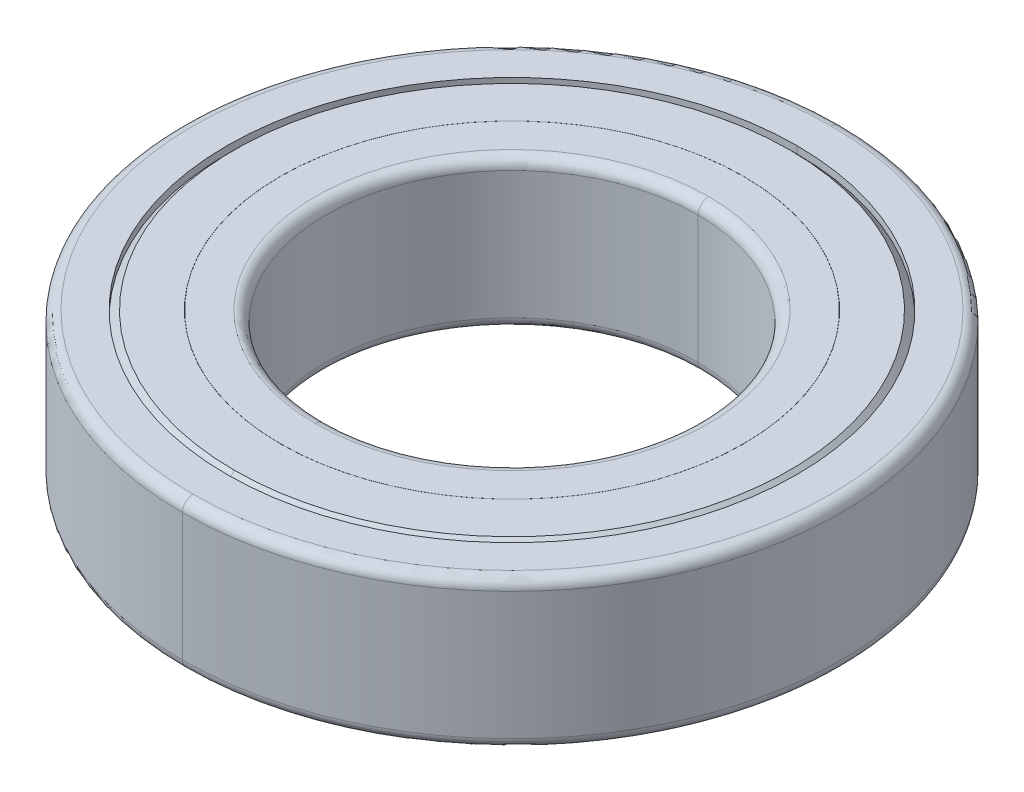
ISO-10303-21;
HEADER;
FILE_DESCRIPTION(('STEP AP214'),'2;1');
FILE_NAME('part.step','',(''),(''),'','','');
FILE_SCHEMA(('AUTOMOTIVE_DESIGN { 1 0 10303 214 1 1 1 1 }'));
ENDSEC;
DATA;
#1=APPLICATION_CONTEXT('core data for automotive mechanical design processes');
#2=APPLICATION_PROTOCOL_DEFINITION('international standard','automotive_design',2000,#1);
#3=PRODUCT_CONTEXT('',#1,'mechanical');
#4=PRODUCT('Part','Part','',(#3));
#5=PRODUCT_RELATED_PRODUCT_CATEGORY('part','',(#4));
#6=PRODUCT_DEFINITION_FORMATION('','',#4);
#7=PRODUCT_DEFINITION_CONTEXT('part definition',#1,'design');
#8=PRODUCT_DEFINITION('design','',#6,#7);
#9=PRODUCT_DEFINITION_SHAPE('','',#8);
#10=(LENGTH_UNIT() NAMED_UNIT(*) SI_UNIT(.MILLI.,.METRE.));
#11=(NAMED_UNIT(*) PLANE_ANGLE_UNIT() SI_UNIT($,.RADIAN.));
#12=(NAMED_UNIT(*) SI_UNIT($,.STERADIAN.) SOLID_ANGLE_UNIT());
#13=UNCERTAINTY_MEASURE_WITH_UNIT(LENGTH_MEASURE(1.E-05),#10,'distance_accuracy_value','');
#14=(GEOMETRIC_REPRESENTATION_CONTEXT(3) GLOBAL_UNCERTAINTY_ASSIGNED_CONTEXT((#13)) GLOBAL_UNIT_ASSIGNED_CONTEXT((#10,
#11,#12)) REPRESENTATION_CONTEXT('',''));
#15=CARTESIAN_POINT('',(0.,0.,0.));
#16=DIRECTION('',(0.,0.,1.));
#17=DIRECTION('',(1.,0.,0.));
#18=AXIS2_PLACEMENT_3D('',#15,#16,#17);
#19=CARTESIAN_POINT('',(0.,-7.,-24.25));
#20=DIRECTION('',(0.,1.,0.));
#21=DIRECTION('',(1.,0.,0.));
#22=AXIS2_PLACEMENT_3D('',#19,#20,#21);
#23=SPHERICAL_SURFACE('',#22,4.05);
#24=CARTESIAN_POINT('',(0.,-7.,-24.25));
#25=DIRECTION('',(0.,1.,0.));
#26=DIRECTION('',(-1.,0.,0.));
#27=AXIS2_PLACEMENT_3D('',#24,#25,#26);
#28=CIRCLE('',#27,4.05);
#29=CARTESIAN_POINT('',(0.,-7.,-28.3));
#30=VERTEX_POINT('',#29);
#31=CARTESIAN_POINT('',(0.,-7.,-20.2));
#32=VERTEX_POINT('',#31);
#33=EDGE_CURVE('P0_E10',#30,#32,#28,.T.);
#34=ORIENTED_EDGE('',*,*,#33,.F.);
#35=CARTESIAN_POINT('',(0.,-7.,-24.25));
#36=DIRECTION('',(0.,-1.,0.));
#37=DIRECTION('',(0.,0.,-1.));
#38=AXIS2_PLACEMENT_3D('',#35,#36,#37);
#39=CIRCLE('',#38,4.05);
#40=EDGE_CURVE('P0_E26',#30,#32,#39,.T.);
#41=ORIENTED_EDGE('',*,*,#40,.T.);
#42=EDGE_LOOP('',(#34,#41));
#43=FACE_BOUND('',#42,.T.);
#44=ADVANCED_FACE('P0_F17',(#43),#23,.T.);
#45=CARTESIAN_POINT('',(0.,-7.,-24.25));
#46=DIRECTION('',(0.,1.,0.));
#47=DIRECTION('',(1.,0.,0.));
#48=AXIS2_PLACEMENT_3D('',#45,#46,#47);
#49=SPHERICAL_SURFACE('',#48,4.05);
#50=ORIENTED_EDGE('',*,*,#40,.F.);
#51=ORIENTED_EDGE('',*,*,#33,.T.);
#52=EDGE_LOOP('',(#50,#51));
#53=FACE_BOUND('',#52,.T.);
#54=ADVANCED_FACE('P0_F19',(#53),#49,.T.);
#55=CLOSED_SHELL('',(#44,#54));
#56=MANIFOLD_SOLID_BREP('P0_B1',#55);
#57=CARTESIAN_POINT('',(0.,-2.44629855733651,0.));
#58=DIRECTION('',(0.,1.,0.));
#59=DIRECTION('',(0.,0.,1.));
#60=AXIS2_PLACEMENT_3D('',#57,#58,#59);
#61=CYLINDRICAL_SURFACE('',#60,22.225);
#62=DIRECTION('',(0.,1.,0.));
#63=VECTOR('',#62,1.);
#64=CARTESIAN_POINT('',(0.,-2.44629855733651,-22.225));
#65=LINE('',#64,#63);
#66=CARTESIAN_POINT('',(0.,-3.49259711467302,-22.225));
#67=VERTEX_POINT('',#66);
#68=CARTESIAN_POINT('',(0.,-1.4,-22.225));
#69=VERTEX_POINT('',#68);
#70=EDGE_CURVE('P1_E161',#67,#69,#65,.T.);
#71=ORIENTED_EDGE('',*,*,#70,.F.);
#72=CARTESIAN_POINT('',(0.,-3.49259711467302,0.));
#73=DIRECTION('',(0.,1.,0.));
#74=DIRECTION('',(0.,0.,1.));
#75=AXIS2_PLACEMENT_3D('',#72,#73,#74);
#76=CIRCLE('',#75,22.225);
#77=CARTESIAN_POINT('',(0.,-3.49259711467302,22.225));
#78=VERTEX_POINT('',#77);
#79=EDGE_CURVE('P1_E153',#67,#78,#76,.T.);
#80=ORIENTED_EDGE('',*,*,#79,.T.);
#81=DIRECTION('',(0.,1.,0.));
#82=VECTOR('',#81,1.);
#83=CARTESIAN_POINT('',(0.,-2.44629855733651,22.225));
#84=LINE('',#83,#82);
#85=CARTESIAN_POINT('',(0.,-1.4,22.225));
#86=VERTEX_POINT('',#85);
#87=EDGE_CURVE('P1_E151',#78,#86,#84,.T.);
#88=ORIENTED_EDGE('',*,*,#87,.T.);
#89=CARTESIAN_POINT('',(0.,-1.4,0.));
#90=DIRECTION('',(0.,1.,0.));
#91=DIRECTION('',(0.,0.,1.));
#92=AXIS2_PLACEMENT_3D('',#89,#90,#91);
#93=CIRCLE('',#92,22.225);
#94=EDGE_CURVE('P1_E11',#69,#86,#93,.T.);
#95=ORIENTED_EDGE('',*,*,#94,.F.);
#96=EDGE_LOOP('',(#71,#80,#88,#95));
#97=FACE_BOUND('',#96,.T.);
#98=ADVANCED_FACE('P1_F18',(#97),#61,.T.);
#99=CARTESIAN_POINT('',(0.,-1.4,22.00275));
#100=DIRECTION('',(0.,1.,0.));
#101=DIRECTION('',(0.,0.,-1.));
#102=AXIS2_PLACEMENT_3D('',#99,#100,#101);
#103=PLANE('',#102);
#104=CARTESIAN_POINT('',(0.,-1.4,0.));
#105=DIRECTION('',(0.,1.,0.));
#106=DIRECTION('',(0.,0.,1.));
#107=AXIS2_PLACEMENT_3D('',#104,#105,#106);
#108=CIRCLE('',#107,21.7805);
#109=CARTESIAN_POINT('',(0.,-1.4,21.7805));
#110=VERTEX_POINT('',#109);
#111=CARTESIAN_POINT('',(0.,-1.4,-21.7805));
#112=VERTEX_POINT('',#111);
#113=EDGE_CURVE('P1_E193',#110,#112,#108,.T.);
#114=ORIENTED_EDGE('',*,*,#113,.F.);
#115=CARTESIAN_POINT('',(0.,-1.4,0.));
#116=DIRECTION('',(0.,1.,0.));
#117=DIRECTION('',(0.,0.,1.));
#118=AXIS2_PLACEMENT_3D('',#115,#116,#117);
#119=CIRCLE('',#118,21.7805);
#120=EDGE_CURVE('P1_E174',#112,#110,#119,.T.);
#121=ORIENTED_EDGE('',*,*,#120,.F.);
#122=EDGE_LOOP('',(#114,#121));
#123=FACE_BOUND('',#122,.T.);
#124=CARTESIAN_POINT('',(0.,-1.4,0.));
#125=DIRECTION('',(0.,1.,0.));
#126=DIRECTION('',(0.,0.,1.));
#127=AXIS2_PLACEMENT_3D('',#124,#125,#126);
#128=CIRCLE('',#127,22.225);
#129=EDGE_CURVE('P1_E147',#86,#69,#128,.T.);
#130=ORIENTED_EDGE('',*,*,#129,.T.);
#131=ORIENTED_EDGE('',*,*,#94,.T.);
#132=EDGE_LOOP('',(#130,#131));
#133=FACE_BOUND('',#132,.T.);
#134=ADVANCED_FACE('P1_F145',(#123,#133),#103,.T.);
#135=CARTESIAN_POINT('',(0.,-11.5537014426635,0.));
#136=DIRECTION('',(0.,1.,0.));
#137=DIRECTION('',(0.,0.,1.));
#138=AXIS2_PLACEMENT_3D('',#135,#136,#137);
#139=CYLINDRICAL_SURFACE('',#138,22.225);
#140=DIRECTION('',(0.,1.,0.));
#141=VECTOR('',#140,1.);
#142=CARTESIAN_POINT('',(0.,-11.5537014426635,-22.225));
#143=LINE('',#142,#141);
#144=CARTESIAN_POINT('',(0.,-12.6,-22.225));
#145=VERTEX_POINT('',#144);
#146=CARTESIAN_POINT('',(0.,-10.507402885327,-22.225));
#147=VERTEX_POINT('',#146);
#148=EDGE_CURVE('P1_E176',#145,#147,#143,.T.);
#149=ORIENTED_EDGE('',*,*,#148,.F.);
#150=CARTESIAN_POINT('',(0.,-12.6,0.));
#151=DIRECTION('',(0.,1.,0.));
#152=DIRECTION('',(0.,0.,1.));
#153=AXIS2_PLACEMENT_3D('',#150,#151,#152);
#154=CIRCLE('',#153,22.225);
#155=CARTESIAN_POINT('',(0.,-12.6,22.225));
#156=VERTEX_POINT('',#155);
#157=EDGE_CURVE('P1_E26',#145,#156,#154,.T.);
#158=ORIENTED_EDGE('',*,*,#157,.T.);
#159=DIRECTION('',(0.,1.,0.));
#160=VECTOR('',#159,1.);
#161=CARTESIAN_POINT('',(0.,-11.5537014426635,22.225));
#162=LINE('',#161,#160);
#163=CARTESIAN_POINT('',(0.,-10.507402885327,22.225));
#164=VERTEX_POINT('',#163);
#165=EDGE_CURVE('P1_E181',#156,#164,#162,.T.);
#166=ORIENTED_EDGE('',*,*,#165,.T.);
#167=CARTESIAN_POINT('',(0.,-10.507402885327,0.));
#168=DIRECTION('',(0.,1.,0.));
#169=DIRECTION('',(0.,0.,1.));
#170=AXIS2_PLACEMENT_3D('',#167,#168,#169);
#171=CIRCLE('',#170,22.225);
#172=EDGE_CURVE('P1_E186',#147,#164,#171,.T.);
#173=ORIENTED_EDGE('',*,*,#172,.F.);
#174=EDGE_LOOP('',(#149,#158,#166,#173));
#175=FACE_BOUND('',#174,.T.);
#176=ADVANCED_FACE('P1_F289',(#175),#139,.T.);
#177=CARTESIAN_POINT('',(0.,-12.6,22.00275));
#178=DIRECTION('',(0.,-1.,0.));
#179=DIRECTION('',(-1.,0.,0.));
#180=AXIS2_PLACEMENT_3D('',#177,#178,#179);
#181=PLANE('',#180);
#182=CARTESIAN_POINT('',(0.,-12.6,0.));
#183=DIRECTION('',(0.,1.,0.));
#184=DIRECTION('',(0.,0.,1.));
#185=AXIS2_PLACEMENT_3D('',#182,#183,#184);
#186=CIRCLE('',#185,21.7805);
#187=CARTESIAN_POINT('',(0.,-12.6,21.7805));
#188=VERTEX_POINT('',#187);
#189=CARTESIAN_POINT('',(0.,-12.6,-21.7805));
#190=VERTEX_POINT('',#189);
#191=EDGE_CURVE('P1_E213',#188,#190,#186,.T.);
#192=ORIENTED_EDGE('',*,*,#191,.T.);
#193=CARTESIAN_POINT('',(0.,-12.6,0.));
#194=DIRECTION('',(0.,1.,0.));
#195=DIRECTION('',(0.,0.,1.));
#196=AXIS2_PLACEMENT_3D('',#193,#194,#195);
#197=CIRCLE('',#196,21.7805);
#198=EDGE_CURVE('P1_E171',#190,#188,#197,.T.);
#199=ORIENTED_EDGE('',*,*,#198,.T.);
#200=EDGE_LOOP('',(#192,#199));
#201=FACE_BOUND('',#200,.T.);
#202=CARTESIAN_POINT('',(0.,-12.6,0.));
#203=DIRECTION('',(0.,1.,0.));
#204=DIRECTION('',(0.,0.,1.));
#205=AXIS2_PLACEMENT_3D('',#202,#203,#204);
#206=CIRCLE('',#205,22.225);
#207=EDGE_CURVE('P1_E158',#156,#145,#206,.T.);
#208=ORIENTED_EDGE('',*,*,#207,.F.);
#209=ORIENTED_EDGE('',*,*,#157,.F.);
#210=EDGE_LOOP('',(#208,#209));
#211=FACE_BOUND('',#210,.T.);
#212=ADVANCED_FACE('P1_F296',(#201,#211),#181,.T.);
#213=CARTESIAN_POINT('',(0.,-7.,0.));
#214=DIRECTION('',(0.,1.,0.));
#215=DIRECTION('',(0.,0.,1.));
#216=AXIS2_PLACEMENT_3D('',#213,#214,#215);
#217=TOROIDAL_SURFACE('',#216,24.25,4.05);
#218=CARTESIAN_POINT('',(0.,-7.,0.));
#219=DIRECTION('',(0.,1.,0.));
#220=DIRECTION('',(-1.,0.,0.));
#221=AXIS2_PLACEMENT_3D('',#218,#219,#220);
#222=CIRCLE('',#221,20.2);
#223=CARTESIAN_POINT('',(0.,-7.,20.2));
#224=VERTEX_POINT('',#223);
#225=CARTESIAN_POINT('',(0.,-7.,-20.2));
#226=VERTEX_POINT('',#225);
#227=EDGE_CURVE('P1_E372',#224,#226,#222,.T.);
#228=ORIENTED_EDGE('',*,*,#227,.F.);
#229=CARTESIAN_POINT('',(0.,-7.,24.25));
#230=DIRECTION('',(-1.,0.,0.));
#231=DIRECTION('',(0.,-1.,0.));
#232=AXIS2_PLACEMENT_3D('',#229,#230,#231);
#233=CIRCLE('',#232,4.05);
#234=EDGE_CURVE('P1_E190',#224,#164,#233,.T.);
#235=ORIENTED_EDGE('',*,*,#234,.T.);
#236=CARTESIAN_POINT('',(0.,-10.507402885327,0.));
#237=DIRECTION('',(0.,1.,0.));
#238=DIRECTION('',(0.,0.,1.));
#239=AXIS2_PLACEMENT_3D('',#236,#237,#238);
#240=CIRCLE('',#239,22.225);
#241=EDGE_CURVE('P1_E180',#164,#147,#240,.T.);
#242=ORIENTED_EDGE('',*,*,#241,.T.);
#243=CARTESIAN_POINT('',(0.,-7.,-24.25));
#244=DIRECTION('',(1.,0.,0.));
#245=DIRECTION('',(0.,1.,0.));
#246=AXIS2_PLACEMENT_3D('',#243,#244,#245);
#247=CIRCLE('',#246,4.05);
#248=EDGE_CURVE('P1_E185',#226,#147,#247,.T.);
#249=ORIENTED_EDGE('',*,*,#248,.F.);
#250=EDGE_LOOP('',(#228,#235,#242,#249));
#251=FACE_BOUND('',#250,.T.);
#252=ADVANCED_FACE('P1_F339',(#251),#217,.F.);
#253=CARTESIAN_POINT('',(0.,-0.7,0.));
#254=DIRECTION('',(0.,1.,0.));
#255=DIRECTION('',(0.,0.,1.));
#256=AXIS2_PLACEMENT_3D('',#253,#254,#255);
#257=CYLINDRICAL_SURFACE('',#256,21.7805);
#258=DIRECTION('',(0.,1.,0.));
#259=VECTOR('',#258,1.);
#260=CARTESIAN_POINT('',(0.,-0.7,-21.7805));
#261=LINE('',#260,#259);
#262=CARTESIAN_POINT('',(0.,0.,-21.7805));
#263=VERTEX_POINT('',#262);
#264=EDGE_CURVE('P1_E197',#112,#263,#261,.T.);
#265=ORIENTED_EDGE('',*,*,#264,.F.);
#266=ORIENTED_EDGE('',*,*,#120,.T.);
#267=DIRECTION('',(0.,1.,0.));
#268=VECTOR('',#267,1.);
#269=CARTESIAN_POINT('',(0.,-0.7,21.7805));
#270=LINE('',#269,#268);
#271=CARTESIAN_POINT('',(0.,0.,21.7805));
#272=VERTEX_POINT('',#271);
#273=EDGE_CURVE('P1_E205',#110,#272,#270,.T.);
#274=ORIENTED_EDGE('',*,*,#273,.T.);
#275=CARTESIAN_POINT('',(0.,0.,0.));
#276=DIRECTION('',(0.,1.,0.));
#277=DIRECTION('',(0.,0.,1.));
#278=AXIS2_PLACEMENT_3D('',#275,#276,#277);
#279=CIRCLE('',#278,21.7805);
#280=EDGE_CURVE('P1_E175',#263,#272,#279,.T.);
#281=ORIENTED_EDGE('',*,*,#280,.F.);
#282=EDGE_LOOP('',(#265,#266,#274,#281));
#283=FACE_BOUND('',#282,.T.);
#284=ADVANCED_FACE('P1_F281',(#283),#257,.T.);
#285=CARTESIAN_POINT('',(0.,-13.3,0.));
#286=DIRECTION('',(0.,1.,0.));
#287=DIRECTION('',(0.,0.,1.));
#288=AXIS2_PLACEMENT_3D('',#285,#286,#287);
#289=CYLINDRICAL_SURFACE('',#288,21.7805);
#290=DIRECTION('',(0.,1.,0.));
#291=VECTOR('',#290,1.);
#292=CARTESIAN_POINT('',(0.,-13.3,-21.7805));
#293=LINE('',#292,#291);
#294=CARTESIAN_POINT('',(0.,-14.,-21.7805));
#295=VERTEX_POINT('',#294);
#296=EDGE_CURVE('P1_E210',#295,#190,#293,.T.);
#297=ORIENTED_EDGE('',*,*,#296,.F.);
#298=CARTESIAN_POINT('',(0.,-14.,0.));
#299=DIRECTION('',(0.,1.,0.));
#300=DIRECTION('',(0.,0.,1.));
#301=AXIS2_PLACEMENT_3D('',#298,#299,#300);
#302=CIRCLE('',#301,21.7805);
#303=CARTESIAN_POINT('',(0.,-14.,21.7805));
#304=VERTEX_POINT('',#303);
#305=EDGE_CURVE('P1_E225',#295,#304,#302,.T.);
#306=ORIENTED_EDGE('',*,*,#305,.T.);
#307=DIRECTION('',(0.,1.,0.));
#308=VECTOR('',#307,1.);
#309=CARTESIAN_POINT('',(0.,-13.3,21.7805));
#310=LINE('',#309,#308);
#311=EDGE_CURVE('P1_E217',#304,#188,#310,.T.);
#312=ORIENTED_EDGE('',*,*,#311,.T.);
#313=ORIENTED_EDGE('',*,*,#198,.F.);
#314=EDGE_LOOP('',(#297,#306,#312,#313));
#315=FACE_BOUND('',#314,.T.);
#316=ADVANCED_FACE('P1_F329',(#315),#289,.T.);
#317=CARTESIAN_POINT('',(0.,0.,20.14025));
#318=DIRECTION('',(0.,1.,0.));
#319=DIRECTION('',(0.,0.,-1.));
#320=AXIS2_PLACEMENT_3D('',#317,#318,#319);
#321=PLANE('',#320);
#322=CARTESIAN_POINT('',(0.,0.,0.));
#323=DIRECTION('',(0.,1.,0.));
#324=DIRECTION('',(0.,0.,1.));
#325=AXIS2_PLACEMENT_3D('',#322,#323,#324);
#326=CIRCLE('',#325,18.5);
#327=CARTESIAN_POINT('',(0.,0.,18.5));
#328=VERTEX_POINT('',#327);
#329=CARTESIAN_POINT('',(0.,0.,-18.5));
#330=VERTEX_POINT('',#329);
#331=EDGE_CURVE('P1_E221',#328,#330,#326,.T.);
#332=ORIENTED_EDGE('',*,*,#331,.F.);
#333=CARTESIAN_POINT('',(0.,0.,0.));
#334=DIRECTION('',(0.,1.,0.));
#335=DIRECTION('',(0.,0.,1.));
#336=AXIS2_PLACEMENT_3D('',#333,#334,#335);
#337=CIRCLE('',#336,18.5);
#338=EDGE_CURVE('P1_E222',#330,#328,#337,.T.);
#339=ORIENTED_EDGE('',*,*,#338,.F.);
#340=EDGE_LOOP('',(#332,#339));
#341=FACE_BOUND('',#340,.T.);
#342=CARTESIAN_POINT('',(0.,0.,0.));
#343=DIRECTION('',(0.,1.,0.));
#344=DIRECTION('',(0.,0.,1.));
#345=AXIS2_PLACEMENT_3D('',#342,#343,#344);
#346=CIRCLE('',#345,21.7805);
#347=EDGE_CURVE('P1_E201',#272,#263,#346,.T.);
#348=ORIENTED_EDGE('',*,*,#347,.T.);
#349=ORIENTED_EDGE('',*,*,#280,.T.);
#350=EDGE_LOOP('',(#348,#349));
#351=FACE_BOUND('',#350,.T.);
#352=ADVANCED_FACE('P1_F276',(#341,#351),#321,.T.);
#353=CARTESIAN_POINT('',(0.,-14.,20.14025));
#354=DIRECTION('',(0.,-1.,0.));
#355=DIRECTION('',(-1.,0.,0.));
#356=AXIS2_PLACEMENT_3D('',#353,#354,#355);
#357=PLANE('',#356);
#358=CARTESIAN_POINT('',(0.,-14.,0.));
#359=DIRECTION('',(0.,1.,0.));
#360=DIRECTION('',(0.,0.,1.));
#361=AXIS2_PLACEMENT_3D('',#358,#359,#360);
#362=CIRCLE('',#361,18.5);
#363=CARTESIAN_POINT('',(0.,-14.,18.5));
#364=VERTEX_POINT('',#363);
#365=CARTESIAN_POINT('',(0.,-14.,-18.5));
#366=VERTEX_POINT('',#365);
#367=EDGE_CURVE('P1_E242',#364,#366,#362,.T.);
#368=ORIENTED_EDGE('',*,*,#367,.T.);
#369=CARTESIAN_POINT('',(0.,-14.,0.));
#370=DIRECTION('',(0.,1.,0.));
#371=DIRECTION('',(0.,0.,1.));
#372=AXIS2_PLACEMENT_3D('',#369,#370,#371);
#373=CIRCLE('',#372,18.5);
#374=EDGE_CURVE('P1_E38',#366,#364,#373,.T.);
#375=ORIENTED_EDGE('',*,*,#374,.T.);
#376=EDGE_LOOP('',(#368,#375));
#377=FACE_BOUND('',#376,.T.);
#378=CARTESIAN_POINT('',(0.,-14.,0.));
#379=DIRECTION('',(0.,1.,0.));
#380=DIRECTION('',(0.,0.,1.));
#381=AXIS2_PLACEMENT_3D('',#378,#379,#380);
#382=CIRCLE('',#381,21.7805);
#383=EDGE_CURVE('P1_E206',#304,#295,#382,.T.);
#384=ORIENTED_EDGE('',*,*,#383,.F.);
#385=ORIENTED_EDGE('',*,*,#305,.F.);
#386=EDGE_LOOP('',(#384,#385));
#387=FACE_BOUND('',#386,.T.);
#388=ADVANCED_FACE('P1_F328',(#377,#387),#357,.T.);
#389=CARTESIAN_POINT('',(0.,-1.,0.));
#390=DIRECTION('',(0.,1.,0.));
#391=DIRECTION('',(0.,0.,1.));
#392=AXIS2_PLACEMENT_3D('',#389,#390,#391);
#393=TOROIDAL_SURFACE('',#392,18.5,1.);
#394=CARTESIAN_POINT('',(0.,-1.,-18.5));
#395=DIRECTION('',(1.,0.,0.));
#396=DIRECTION('',(0.,1.,0.));
#397=AXIS2_PLACEMENT_3D('',#394,#395,#396);
#398=CIRCLE('',#397,1.);
#399=CARTESIAN_POINT('',(0.,-1.,-17.5));
#400=VERTEX_POINT('',#399);
#401=EDGE_CURVE('P1_E229',#330,#400,#398,.T.);
#402=ORIENTED_EDGE('',*,*,#401,.F.);
#403=ORIENTED_EDGE('',*,*,#338,.T.);
#404=CARTESIAN_POINT('',(0.,-1.,18.5));
#405=DIRECTION('',(-1.,0.,0.));
#406=DIRECTION('',(0.,-1.,0.));
#407=AXIS2_PLACEMENT_3D('',#404,#405,#406);
#408=CIRCLE('',#407,1.);
#409=CARTESIAN_POINT('',(0.,-1.,17.5));
#410=VERTEX_POINT('',#409);
#411=EDGE_CURVE('P1_E237',#328,#410,#408,.T.);
#412=ORIENTED_EDGE('',*,*,#411,.T.);
#413=CARTESIAN_POINT('',(0.,-1.,0.));
#414=DIRECTION('',(0.,1.,0.));
#415=DIRECTION('',(0.,0.,1.));
#416=AXIS2_PLACEMENT_3D('',#413,#414,#415);
#417=CIRCLE('',#416,17.5);
#418=EDGE_CURVE('P1_E261',#400,#410,#417,.T.);
#419=ORIENTED_EDGE('',*,*,#418,.F.);
#420=EDGE_LOOP('',(#402,#403,#412,#419));
#421=FACE_BOUND('',#420,.T.);
#422=ADVANCED_FACE('P1_F331',(#421),#393,.T.);
#423=CARTESIAN_POINT('',(0.,-13.,0.));
#424=DIRECTION('',(0.,1.,0.));
#425=DIRECTION('',(0.,0.,1.));
#426=AXIS2_PLACEMENT_3D('',#423,#424,#425);
#427=TOROIDAL_SURFACE('',#426,18.5,1.);
#428=CARTESIAN_POINT('',(0.,-13.,-18.5));
#429=DIRECTION('',(1.,0.,0.));
#430=DIRECTION('',(0.,1.,0.));
#431=AXIS2_PLACEMENT_3D('',#428,#429,#430);
#432=CIRCLE('',#431,1.);
#433=CARTESIAN_POINT('',(0.,-13.,-17.5));
#434=VERTEX_POINT('',#433);
#435=EDGE_CURVE('P1_E238',#434,#366,#432,.T.);
#436=ORIENTED_EDGE('',*,*,#435,.F.);
#437=CARTESIAN_POINT('',(0.,-13.,0.));
#438=DIRECTION('',(0.,1.,0.));
#439=DIRECTION('',(0.,0.,1.));
#440=AXIS2_PLACEMENT_3D('',#437,#438,#439);
#441=CIRCLE('',#440,17.5);
#442=CARTESIAN_POINT('',(0.,-13.,17.5));
#443=VERTEX_POINT('',#442);
#444=EDGE_CURVE('P1_E253',#434,#443,#441,.T.);
#445=ORIENTED_EDGE('',*,*,#444,.T.);
#446=CARTESIAN_POINT('',(0.,-13.,18.5));
#447=DIRECTION('',(-1.,0.,0.));
#448=DIRECTION('',(0.,-1.,0.));
#449=AXIS2_PLACEMENT_3D('',#446,#447,#448);
#450=CIRCLE('',#449,1.);
#451=EDGE_CURVE('P1_E252',#443,#364,#450,.T.);
#452=ORIENTED_EDGE('',*,*,#451,.T.);
#453=ORIENTED_EDGE('',*,*,#374,.F.);
#454=EDGE_LOOP('',(#436,#445,#452,#453));
#455=FACE_BOUND('',#454,.T.);
#456=ADVANCED_FACE('P1_F324',(#455),#427,.T.);
#457=CARTESIAN_POINT('',(0.,-7.,0.));
#458=DIRECTION('',(0.,1.,0.));
#459=DIRECTION('',(0.,0.,1.));
#460=AXIS2_PLACEMENT_3D('',#457,#458,#459);
#461=CYLINDRICAL_SURFACE('',#460,17.5);
#462=DIRECTION('',(0.,1.,0.));
#463=VECTOR('',#462,1.);
#464=CARTESIAN_POINT('',(0.,-7.,-17.5));
#465=LINE('',#464,#463);
#466=EDGE_CURVE('P1_E257',#434,#400,#465,.T.);
#467=ORIENTED_EDGE('',*,*,#466,.F.);
#468=CARTESIAN_POINT('',(0.,-13.,0.));
#469=DIRECTION('',(0.,1.,0.));
#470=DIRECTION('',(0.,0.,1.));
#471=AXIS2_PLACEMENT_3D('',#468,#469,#470);
#472=CIRCLE('',#471,17.5);
#473=EDGE_CURVE('P1_E243',#443,#434,#472,.T.);
#474=ORIENTED_EDGE('',*,*,#473,.F.);
#475=DIRECTION('',(0.,1.,0.));
#476=VECTOR('',#475,1.);
#477=CARTESIAN_POINT('',(0.,-7.,17.5));
#478=LINE('',#477,#476);
#479=EDGE_CURVE('P1_E265',#443,#410,#478,.T.);
#480=ORIENTED_EDGE('',*,*,#479,.T.);
#481=CARTESIAN_POINT('',(0.,-1.,0.));
#482=DIRECTION('',(0.,1.,0.));
#483=DIRECTION('',(0.,0.,1.));
#484=AXIS2_PLACEMENT_3D('',#481,#482,#483);
#485=CIRCLE('',#484,17.5);
#486=EDGE_CURVE('P1_E233',#410,#400,#485,.T.);
#487=ORIENTED_EDGE('',*,*,#486,.T.);
#488=EDGE_LOOP('',(#467,#474,#480,#487));
#489=FACE_BOUND('',#488,.T.);
#490=ADVANCED_FACE('P1_F321',(#489),#461,.F.);
#491=CARTESIAN_POINT('',(0.,-7.,0.));
#492=DIRECTION('',(0.,1.,0.));
#493=DIRECTION('',(0.,0.,1.));
#494=AXIS2_PLACEMENT_3D('',#491,#492,#493);
#495=CYLINDRICAL_SURFACE('',#494,17.5);
#496=ORIENTED_EDGE('',*,*,#444,.F.);
#497=ORIENTED_EDGE('',*,*,#466,.T.);
#498=ORIENTED_EDGE('',*,*,#418,.T.);
#499=ORIENTED_EDGE('',*,*,#479,.F.);
#500=EDGE_LOOP('',(#496,#497,#498,#499));
#501=FACE_BOUND('',#500,.T.);
#502=ADVANCED_FACE('P1_F306',(#501),#495,.F.);
#503=CARTESIAN_POINT('',(0.,-13.,0.));
#504=DIRECTION('',(0.,1.,0.));
#505=DIRECTION('',(0.,0.,1.));
#506=AXIS2_PLACEMENT_3D('',#503,#504,#505);
#507=TOROIDAL_SURFACE('',#506,18.5,1.);
#508=ORIENTED_EDGE('',*,*,#473,.T.);
#509=ORIENTED_EDGE('',*,*,#435,.T.);
#510=ORIENTED_EDGE('',*,*,#367,.F.);
#511=ORIENTED_EDGE('',*,*,#451,.F.);
#512=EDGE_LOOP('',(#508,#509,#510,#511));
#513=FACE_BOUND('',#512,.T.);
#514=ADVANCED_FACE('P1_F302',(#513),#507,.T.);
#515=CARTESIAN_POINT('',(0.,-1.,0.));
#516=DIRECTION('',(0.,1.,0.));
#517=DIRECTION('',(0.,0.,1.));
#518=AXIS2_PLACEMENT_3D('',#515,#516,#517);
#519=TOROIDAL_SURFACE('',#518,18.5,1.);
#520=ORIENTED_EDGE('',*,*,#331,.T.);
#521=ORIENTED_EDGE('',*,*,#401,.T.);
#522=ORIENTED_EDGE('',*,*,#486,.F.);
#523=ORIENTED_EDGE('',*,*,#411,.F.);
#524=EDGE_LOOP('',(#520,#521,#522,#523));
#525=FACE_BOUND('',#524,.T.);
#526=ADVANCED_FACE('P1_F305',(#525),#519,.T.);
#527=CARTESIAN_POINT('',(0.,-13.3,0.));
#528=DIRECTION('',(0.,1.,0.));
#529=DIRECTION('',(0.,0.,1.));
#530=AXIS2_PLACEMENT_3D('',#527,#528,#529);
#531=CYLINDRICAL_SURFACE('',#530,21.7805);
#532=ORIENTED_EDGE('',*,*,#383,.T.);
#533=ORIENTED_EDGE('',*,*,#296,.T.);
#534=ORIENTED_EDGE('',*,*,#191,.F.);
#535=ORIENTED_EDGE('',*,*,#311,.F.);
#536=EDGE_LOOP('',(#532,#533,#534,#535));
#537=FACE_BOUND('',#536,.T.);
#538=ADVANCED_FACE('P1_F314',(#537),#531,.T.);
#539=CARTESIAN_POINT('',(0.,-0.7,0.));
#540=DIRECTION('',(0.,1.,0.));
#541=DIRECTION('',(0.,0.,1.));
#542=AXIS2_PLACEMENT_3D('',#539,#540,#541);
#543=CYLINDRICAL_SURFACE('',#542,21.7805);
#544=ORIENTED_EDGE('',*,*,#113,.T.);
#545=ORIENTED_EDGE('',*,*,#264,.T.);
#546=ORIENTED_EDGE('',*,*,#347,.F.);
#547=ORIENTED_EDGE('',*,*,#273,.F.);
#548=EDGE_LOOP('',(#544,#545,#546,#547));
#549=FACE_BOUND('',#548,.T.);
#550=ADVANCED_FACE('P1_F286',(#549),#543,.T.);
#551=CARTESIAN_POINT('',(0.,-7.,0.));
#552=DIRECTION('',(0.,1.,0.));
#553=DIRECTION('',(0.,0.,1.));
#554=AXIS2_PLACEMENT_3D('',#551,#552,#553);
#555=TOROIDAL_SURFACE('',#554,24.25,4.05);
#556=CARTESIAN_POINT('',(0.,-7.,0.));
#557=DIRECTION('',(0.,1.,0.));
#558=DIRECTION('',(-1.,0.,0.));
#559=AXIS2_PLACEMENT_3D('',#556,#557,#558);
#560=CIRCLE('',#559,20.2);
#561=EDGE_CURVE('P1_E364',#226,#224,#560,.T.);
#562=ORIENTED_EDGE('',*,*,#561,.F.);
#563=ORIENTED_EDGE('',*,*,#248,.T.);
#564=ORIENTED_EDGE('',*,*,#172,.T.);
#565=ORIENTED_EDGE('',*,*,#234,.F.);
#566=EDGE_LOOP('',(#562,#563,#564,#565));
#567=FACE_BOUND('',#566,.T.);
#568=ADVANCED_FACE('P1_F308',(#567),#555,.F.);
#569=CARTESIAN_POINT('',(0.,-11.5537014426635,0.));
#570=DIRECTION('',(0.,1.,0.));
#571=DIRECTION('',(0.,0.,1.));
#572=AXIS2_PLACEMENT_3D('',#569,#570,#571);
#573=CYLINDRICAL_SURFACE('',#572,22.225);
#574=ORIENTED_EDGE('',*,*,#207,.T.);
#575=ORIENTED_EDGE('',*,*,#148,.T.);
#576=ORIENTED_EDGE('',*,*,#241,.F.);
#577=ORIENTED_EDGE('',*,*,#165,.F.);
#578=EDGE_LOOP('',(#574,#575,#576,#577));
#579=FACE_BOUND('',#578,.T.);
#580=ADVANCED_FACE('P1_F300',(#579),#573,.T.);
#581=CARTESIAN_POINT('',(0.,-2.44629855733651,0.));
#582=DIRECTION('',(0.,1.,0.));
#583=DIRECTION('',(0.,0.,1.));
#584=AXIS2_PLACEMENT_3D('',#581,#582,#583);
#585=CYLINDRICAL_SURFACE('',#584,22.225);
#586=CARTESIAN_POINT('',(0.,-3.49259711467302,0.));
#587=DIRECTION('',(0.,1.,0.));
#588=DIRECTION('',(0.,0.,1.));
#589=AXIS2_PLACEMENT_3D('',#586,#587,#588);
#590=CIRCLE('',#589,22.225);
#591=EDGE_CURVE('P1_E361',#78,#67,#590,.T.);
#592=ORIENTED_EDGE('',*,*,#591,.T.);
#593=ORIENTED_EDGE('',*,*,#70,.T.);
#594=ORIENTED_EDGE('',*,*,#129,.F.);
#595=ORIENTED_EDGE('',*,*,#87,.F.);
#596=EDGE_LOOP('',(#592,#593,#594,#595));
#597=FACE_BOUND('',#596,.T.);
#598=ADVANCED_FACE('P1_F160',(#597),#585,.T.);
#599=CARTESIAN_POINT('',(0.,-7.,0.));
#600=DIRECTION('',(0.,1.,0.));
#601=DIRECTION('',(0.,0.,1.));
#602=AXIS2_PLACEMENT_3D('',#599,#600,#601);
#603=TOROIDAL_SURFACE('',#602,24.25,4.05);
#604=CARTESIAN_POINT('',(0.,-7.,-24.25));
#605=DIRECTION('',(1.,0.,0.));
#606=DIRECTION('',(0.,1.,0.));
#607=AXIS2_PLACEMENT_3D('',#604,#605,#606);
#608=CIRCLE('',#607,4.05);
#609=EDGE_CURVE('P1_E365',#67,#226,#608,.T.);
#610=ORIENTED_EDGE('',*,*,#609,.T.);
#611=ORIENTED_EDGE('',*,*,#561,.T.);
#612=CARTESIAN_POINT('',(0.,-7.,24.25));
#613=DIRECTION('',(-1.,0.,0.));
#614=DIRECTION('',(0.,-1.,0.));
#615=AXIS2_PLACEMENT_3D('',#612,#613,#614);
#616=CIRCLE('',#615,4.05);
#617=EDGE_CURVE('P1_E368',#78,#224,#616,.T.);
#618=ORIENTED_EDGE('',*,*,#617,.F.);
#619=ORIENTED_EDGE('',*,*,#79,.F.);
#620=EDGE_LOOP('',(#610,#611,#618,#619));
#621=FACE_BOUND('',#620,.T.);
#622=ADVANCED_FACE('P1_F572',(#621),#603,.F.);
#623=CARTESIAN_POINT('',(0.,-7.,0.));
#624=DIRECTION('',(0.,1.,0.));
#625=DIRECTION('',(0.,0.,1.));
#626=AXIS2_PLACEMENT_3D('',#623,#624,#625);
#627=TOROIDAL_SURFACE('',#626,24.25,4.05);
#628=ORIENTED_EDGE('',*,*,#617,.T.);
#629=ORIENTED_EDGE('',*,*,#227,.T.);
#630=ORIENTED_EDGE('',*,*,#609,.F.);
#631=ORIENTED_EDGE('',*,*,#591,.F.);
#632=EDGE_LOOP('',(#628,#629,#630,#631));
#633=FACE_BOUND('',#632,.T.);
#634=ADVANCED_FACE('P1_F568',(#633),#627,.F.);
#635=CLOSED_SHELL('',(#98,#134,#176,#212,#252,#284,#316,#352,#388,#422,#456,#490,#502,#514,#526,
#538,#550,#568,#580,#598,#622,#634));
#636=MANIFOLD_SOLID_BREP('P1_B1',#635);
#637=CARTESIAN_POINT('',(-9.28007323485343,-7.,22.4040786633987));
#638=DIRECTION('',(0.,1.,0.));
#639=DIRECTION('',(1.,0.,0.));
#640=AXIS2_PLACEMENT_3D('',#637,#638,#639);
#641=SPHERICAL_SURFACE('',#640,4.05);
#642=CARTESIAN_POINT('',(-9.28007323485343,-7.,22.4040786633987));
#643=DIRECTION('',(0.,1.,0.));
#644=DIRECTION('',(-1.,0.,0.));
#645=AXIS2_PLACEMENT_3D('',#642,#643,#644);
#646=CIRCLE('',#645,4.05);
#647=CARTESIAN_POINT('',(-9.28007323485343,-7.,18.3540786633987));
#648=VERTEX_POINT('',#647);
#649=CARTESIAN_POINT('',(-9.28007323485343,-7.,26.4540786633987));
#650=VERTEX_POINT('',#649);
#651=EDGE_CURVE('P2_E11',#648,#650,#646,.T.);
#652=ORIENTED_EDGE('',*,*,#651,.F.);
#653=CARTESIAN_POINT('',(-9.28007323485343,-7.,22.4040786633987));
#654=DIRECTION('',(0.,-1.,0.));
#655=DIRECTION('',(0.,0.,-1.));
#656=AXIS2_PLACEMENT_3D('',#653,#654,#655);
#657=CIRCLE('',#656,4.05);
#658=EDGE_CURVE('P2_E26',#648,#650,#657,.T.);
#659=ORIENTED_EDGE('',*,*,#658,.T.);
#660=EDGE_LOOP('',(#652,#659));
#661=FACE_BOUND('',#660,.T.);
#662=ADVANCED_FACE('P2_F18',(#661),#641,.T.);
#663=CARTESIAN_POINT('',(-9.28007323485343,-7.,22.4040786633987));
#664=DIRECTION('',(0.,1.,0.));
#665=DIRECTION('',(1.,0.,0.));
#666=AXIS2_PLACEMENT_3D('',#663,#664,#665);
#667=SPHERICAL_SURFACE('',#666,4.05);
#668=ORIENTED_EDGE('',*,*,#658,.F.);
#669=ORIENTED_EDGE('',*,*,#651,.T.);
#670=EDGE_LOOP('',(#668,#669));
#671=FACE_BOUND('',#670,.T.);
#672=ADVANCED_FACE('P2_F42',(#671),#667,.T.);
#673=CLOSED_SHELL('',(#662,#672));
#674=MANIFOLD_SOLID_BREP('P2_B1',#673);
#675=CARTESIAN_POINT('',(17.1473394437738,-7.,17.1473394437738));
#676=DIRECTION('',(0.,1.,0.));
#677=DIRECTION('',(1.,0.,0.));
#678=AXIS2_PLACEMENT_3D('',#675,#676,#677);
#679=SPHERICAL_SURFACE('',#678,4.05);
#680=CARTESIAN_POINT('',(17.1473394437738,-7.,17.1473394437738));
#681=DIRECTION('',(0.,1.,0.));
#682=DIRECTION('',(-1.,0.,0.));
#683=AXIS2_PLACEMENT_3D('',#680,#681,#682);
#684=CIRCLE('',#683,4.05);
#685=CARTESIAN_POINT('',(17.1473394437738,-7.,13.0973394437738));
#686=VERTEX_POINT('',#685);
#687=CARTESIAN_POINT('',(17.1473394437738,-7.,21.1973394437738));
#688=VERTEX_POINT('',#687);
#689=EDGE_CURVE('P3_E11',#686,#688,#684,.T.);
#690=ORIENTED_EDGE('',*,*,#689,.F.);
#691=CARTESIAN_POINT('',(17.1473394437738,-7.,17.1473394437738));
#692=DIRECTION('',(0.,-1.,0.));
#693=DIRECTION('',(0.,0.,-1.));
#694=AXIS2_PLACEMENT_3D('',#691,#692,#693);
#695=CIRCLE('',#694,4.05);
#696=EDGE_CURVE('P3_E26',#686,#688,#695,.T.);
#697=ORIENTED_EDGE('',*,*,#696,.T.);
#698=EDGE_LOOP('',(#690,#697));
#699=FACE_BOUND('',#698,.T.);
#700=ADVANCED_FACE('P3_F18',(#699),#679,.T.);
#701=CARTESIAN_POINT('',(17.1473394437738,-7.,17.1473394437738));
#702=DIRECTION('',(0.,1.,0.));
#703=DIRECTION('',(1.,0.,0.));
#704=AXIS2_PLACEMENT_3D('',#701,#702,#703);
#705=SPHERICAL_SURFACE('',#704,4.05);
#706=ORIENTED_EDGE('',*,*,#696,.F.);
#707=ORIENTED_EDGE('',*,*,#689,.T.);
#708=EDGE_LOOP('',(#706,#707));
#709=FACE_BOUND('',#708,.T.);
#710=ADVANCED_FACE('P3_F42',(#709),#705,.T.);
#711=CLOSED_SHELL('',(#700,#710));
#712=MANIFOLD_SOLID_BREP('P3_B1',#711);
#713=CARTESIAN_POINT('',(-17.1473394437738,-7.,-17.1473394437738));
#714=DIRECTION('',(0.,1.,0.));
#715=DIRECTION('',(1.,0.,0.));
#716=AXIS2_PLACEMENT_3D('',#713,#714,#715);
#717=SPHERICAL_SURFACE('',#716,4.05);
#718=CARTESIAN_POINT('',(-17.1473394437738,-7.,-17.1473394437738));
#719=DIRECTION('',(0.,1.,0.));
#720=DIRECTION('',(-1.,0.,0.));
#721=AXIS2_PLACEMENT_3D('',#718,#719,#720);
#722=CIRCLE('',#721,4.05);
#723=CARTESIAN_POINT('',(-17.1473394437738,-7.,-21.1973394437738));
#724=VERTEX_POINT('',#723);
#725=CARTESIAN_POINT('',(-17.1473394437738,-7.,-13.0973394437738));
#726=VERTEX_POINT('',#725);
#727=EDGE_CURVE('P4_E11',#724,#726,#722,.T.);
#728=ORIENTED_EDGE('',*,*,#727,.F.);
#729=CARTESIAN_POINT('',(-17.1473394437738,-7.,-17.1473394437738));
#730=DIRECTION('',(0.,-1.,0.));
#731=DIRECTION('',(0.,0.,-1.));
#732=AXIS2_PLACEMENT_3D('',#729,#730,#731);
#733=CIRCLE('',#732,4.05);
#734=EDGE_CURVE('P4_E26',#724,#726,#733,.T.);
#735=ORIENTED_EDGE('',*,*,#734,.T.);
#736=EDGE_LOOP('',(#728,#735));
#737=FACE_BOUND('',#736,.T.);
#738=ADVANCED_FACE('P4_F18',(#737),#717,.T.);
#739=CARTESIAN_POINT('',(-17.1473394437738,-7.,-17.1473394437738));
#740=DIRECTION('',(0.,1.,0.));
#741=DIRECTION('',(1.,0.,0.));
#742=AXIS2_PLACEMENT_3D('',#739,#740,#741);
#743=SPHERICAL_SURFACE('',#742,4.05);
#744=ORIENTED_EDGE('',*,*,#734,.F.);
#745=ORIENTED_EDGE('',*,*,#727,.T.);
#746=EDGE_LOOP('',(#744,#745));
#747=FACE_BOUND('',#746,.T.);
#748=ADVANCED_FACE('P4_F42',(#747),#743,.T.);
#749=CLOSED_SHELL('',(#738,#748));
#750=MANIFOLD_SOLID_BREP('P4_B1',#749);
#751=CARTESIAN_POINT('',(0.,-7.,24.25));
#752=DIRECTION('',(0.,1.,0.));
#753=DIRECTION('',(1.,0.,0.));
#754=AXIS2_PLACEMENT_3D('',#751,#752,#753);
#755=SPHERICAL_SURFACE('',#754,4.05);
#756=CARTESIAN_POINT('',(0.,-7.,24.25));
#757=DIRECTION('',(0.,1.,0.));
#758=DIRECTION('',(-1.,0.,0.));
#759=AXIS2_PLACEMENT_3D('',#756,#757,#758);
#760=CIRCLE('',#759,4.05);
#761=CARTESIAN_POINT('',(0.,-7.,20.2));
#762=VERTEX_POINT('',#761);
#763=CARTESIAN_POINT('',(0.,-7.,28.3));
#764=VERTEX_POINT('',#763);
#765=EDGE_CURVE('P5_E11',#762,#764,#760,.T.);
#766=ORIENTED_EDGE('',*,*,#765,.F.);
#767=CARTESIAN_POINT('',(0.,-7.,24.25));
#768=DIRECTION('',(0.,-1.,0.));
#769=DIRECTION('',(0.,0.,-1.));
#770=AXIS2_PLACEMENT_3D('',#767,#768,#769);
#771=CIRCLE('',#770,4.05);
#772=EDGE_CURVE('P5_E26',#762,#764,#771,.T.);
#773=ORIENTED_EDGE('',*,*,#772,.T.);
#774=EDGE_LOOP('',(#766,#773));
#775=FACE_BOUND('',#774,.T.);
#776=ADVANCED_FACE('P5_F18',(#775),#755,.T.);
#777=CARTESIAN_POINT('',(0.,-7.,24.25));
#778=DIRECTION('',(0.,1.,0.));
#779=DIRECTION('',(1.,0.,0.));
#780=AXIS2_PLACEMENT_3D('',#777,#778,#779);
#781=SPHERICAL_SURFACE('',#780,4.05);
#782=ORIENTED_EDGE('',*,*,#772,.F.);
#783=ORIENTED_EDGE('',*,*,#765,.T.);
#784=EDGE_LOOP('',(#782,#783));
#785=FACE_BOUND('',#784,.T.);
#786=ADVANCED_FACE('P5_F42',(#785),#781,.T.);
#787=CLOSED_SHELL('',(#776,#786));
#788=MANIFOLD_SOLID_BREP('P5_B1',#787);
#789=CARTESIAN_POINT('',(22.4040786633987,-7.,9.28007323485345));
#790=DIRECTION('',(0.,1.,0.));
#791=DIRECTION('',(1.,0.,0.));
#792=AXIS2_PLACEMENT_3D('',#789,#790,#791);
#793=SPHERICAL_SURFACE('',#792,4.05);
#794=CARTESIAN_POINT('',(22.4040786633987,-7.,9.28007323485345));
#795=DIRECTION('',(0.,1.,0.));
#796=DIRECTION('',(-1.,0.,0.));
#797=AXIS2_PLACEMENT_3D('',#794,#795,#796);
#798=CIRCLE('',#797,4.05);
#799=CARTESIAN_POINT('',(22.4040786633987,-7.,5.23007323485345));
#800=VERTEX_POINT('',#799);
#801=CARTESIAN_POINT('',(22.4040786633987,-7.,13.3300732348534));
#802=VERTEX_POINT('',#801);
#803=EDGE_CURVE('P6_E11',#800,#802,#798,.T.);
#804=ORIENTED_EDGE('',*,*,#803,.F.);
#805=CARTESIAN_POINT('',(22.4040786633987,-7.,9.28007323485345));
#806=DIRECTION('',(0.,-1.,0.));
#807=DIRECTION('',(0.,0.,-1.));
#808=AXIS2_PLACEMENT_3D('',#805,#806,#807);
#809=CIRCLE('',#808,4.05);
#810=EDGE_CURVE('P6_E26',#800,#802,#809,.T.);
#811=ORIENTED_EDGE('',*,*,#810,.T.);
#812=EDGE_LOOP('',(#804,#811));
#813=FACE_BOUND('',#812,.T.);
#814=ADVANCED_FACE('P6_F18',(#813),#793,.T.);
#815=CARTESIAN_POINT('',(22.4040786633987,-7.,9.28007323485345));
#816=DIRECTION('',(0.,1.,0.));
#817=DIRECTION('',(1.,0.,0.));
#818=AXIS2_PLACEMENT_3D('',#815,#816,#817);
#819=SPHERICAL_SURFACE('',#818,4.05);
#820=ORIENTED_EDGE('',*,*,#810,.F.);
#821=ORIENTED_EDGE('',*,*,#803,.T.);
#822=EDGE_LOOP('',(#820,#821));
#823=FACE_BOUND('',#822,.T.);
#824=ADVANCED_FACE('P6_F42',(#823),#819,.T.);
#825=CLOSED_SHELL('',(#814,#824));
#826=MANIFOLD_SOLID_BREP('P6_B1',#825);
#827=CARTESIAN_POINT('',(24.25,-7.,0.));
#828=DIRECTION('',(0.,1.,0.));
#829=DIRECTION('',(1.,0.,0.));
#830=AXIS2_PLACEMENT_3D('',#827,#828,#829);
#831=SPHERICAL_SURFACE('',#830,4.05);
#832=CARTESIAN_POINT('',(24.25,-7.,0.));
#833=DIRECTION('',(0.,1.,0.));
#834=DIRECTION('',(-1.,0.,0.));
#835=AXIS2_PLACEMENT_3D('',#832,#833,#834);
#836=CIRCLE('',#835,4.05);
#837=CARTESIAN_POINT('',(24.25,-7.,-4.05));
#838=VERTEX_POINT('',#837);
#839=CARTESIAN_POINT('',(24.25,-7.,4.05));
#840=VERTEX_POINT('',#839);
#841=EDGE_CURVE('P7_E11',#838,#840,#836,.T.);
#842=ORIENTED_EDGE('',*,*,#841,.F.);
#843=CARTESIAN_POINT('',(24.25,-7.,0.));
#844=DIRECTION('',(0.,-1.,0.));
#845=DIRECTION('',(0.,0.,-1.));
#846=AXIS2_PLACEMENT_3D('',#843,#844,#845);
#847=CIRCLE('',#846,4.05);
#848=EDGE_CURVE('P7_E27',#838,#840,#847,.T.);
#849=ORIENTED_EDGE('',*,*,#848,.T.);
#850=EDGE_LOOP('',(#842,#849));
#851=FACE_BOUND('',#850,.T.);
#852=ADVANCED_FACE('P7_F18',(#851),#831,.T.);
#853=CARTESIAN_POINT('',(24.25,-7.,0.));
#854=DIRECTION('',(0.,1.,0.));
#855=DIRECTION('',(1.,0.,0.));
#856=AXIS2_PLACEMENT_3D('',#853,#854,#855);
#857=SPHERICAL_SURFACE('',#856,4.05);
#858=ORIENTED_EDGE('',*,*,#848,.F.);
#859=ORIENTED_EDGE('',*,*,#841,.T.);
#860=EDGE_LOOP('',(#858,#859));
#861=FACE_BOUND('',#860,.T.);
#862=ADVANCED_FACE('P7_F20',(#861),#857,.T.);
#863=CLOSED_SHELL('',(#852,#862));
#864=MANIFOLD_SOLID_BREP('P7_B1',#863);
#865=CARTESIAN_POINT('',(9.28007323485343,-7.,-22.4040786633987));
#866=DIRECTION('',(0.,1.,0.));
#867=DIRECTION('',(1.,0.,0.));
#868=AXIS2_PLACEMENT_3D('',#865,#866,#867);
#869=SPHERICAL_SURFACE('',#868,4.05);
#870=CARTESIAN_POINT('',(9.28007323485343,-7.,-22.4040786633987));
#871=DIRECTION('',(0.,1.,0.));
#872=DIRECTION('',(-1.,0.,0.));
#873=AXIS2_PLACEMENT_3D('',#870,#871,#872);
#874=CIRCLE('',#873,4.05);
#875=CARTESIAN_POINT('',(9.28007323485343,-7.,-26.4540786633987));
#876=VERTEX_POINT('',#875);
#877=CARTESIAN_POINT('',(9.28007323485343,-7.,-18.3540786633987));
#878=VERTEX_POINT('',#877);
#879=EDGE_CURVE('P8_E11',#876,#878,#874,.T.);
#880=ORIENTED_EDGE('',*,*,#879,.F.);
#881=CARTESIAN_POINT('',(9.28007323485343,-7.,-22.4040786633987));
#882=DIRECTION('',(0.,-1.,0.));
#883=DIRECTION('',(0.,0.,-1.));
#884=AXIS2_PLACEMENT_3D('',#881,#882,#883);
#885=CIRCLE('',#884,4.05);
#886=EDGE_CURVE('P8_E26',#876,#878,#885,.T.);
#887=ORIENTED_EDGE('',*,*,#886,.T.);
#888=EDGE_LOOP('',(#880,#887));
#889=FACE_BOUND('',#888,.T.);
#890=ADVANCED_FACE('P8_F18',(#889),#869,.T.);
#891=CARTESIAN_POINT('',(9.28007323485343,-7.,-22.4040786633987));
#892=DIRECTION('',(0.,1.,0.));
#893=DIRECTION('',(1.,0.,0.));
#894=AXIS2_PLACEMENT_3D('',#891,#892,#893);
#895=SPHERICAL_SURFACE('',#894,4.05);
#896=ORIENTED_EDGE('',*,*,#886,.F.);
#897=ORIENTED_EDGE('',*,*,#879,.T.);
#898=EDGE_LOOP('',(#896,#897));
#899=FACE_BOUND('',#898,.T.);
#900=ADVANCED_FACE('P8_F42',(#899),#895,.T.);
#901=CLOSED_SHELL('',(#890,#900));
#902=MANIFOLD_SOLID_BREP('P8_B1',#901);
#903=CARTESIAN_POINT('',(0.,-2.44629855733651,0.));
#904=DIRECTION('',(0.,1.,0.));
#905=DIRECTION('',(0.,0.,1.));
#906=AXIS2_PLACEMENT_3D('',#903,#904,#905);
#907=CYLINDRICAL_SURFACE('',#906,26.275);
#908=DIRECTION('',(0.,1.,0.));
#909=VECTOR('',#908,1.);
#910=CARTESIAN_POINT('',(0.,-2.44629855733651,-26.275));
#911=LINE('',#910,#909);
#912=CARTESIAN_POINT('',(0.,-3.49259711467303,-26.275));
#913=VERTEX_POINT('',#912);
#914=CARTESIAN_POINT('',(0.,-1.4,-26.275));
#915=VERTEX_POINT('',#914);
#916=EDGE_CURVE('P9_E246',#913,#915,#911,.T.);
#917=ORIENTED_EDGE('',*,*,#916,.F.);
#918=CARTESIAN_POINT('',(0.,-3.49259711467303,0.));
#919=DIRECTION('',(0.,1.,0.));
#920=DIRECTION('',(0.,0.,1.));
#921=AXIS2_PLACEMENT_3D('',#918,#919,#920);
#922=CIRCLE('',#921,26.275);
#923=CARTESIAN_POINT('',(0.,-3.49259711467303,26.275));
#924=VERTEX_POINT('',#923);
#925=EDGE_CURVE('P9_E219',#924,#913,#922,.T.);
#926=ORIENTED_EDGE('',*,*,#925,.F.);
#927=DIRECTION('',(0.,1.,0.));
#928=VECTOR('',#927,1.);
#929=CARTESIAN_POINT('',(0.,-2.44629855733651,26.275));
#930=LINE('',#929,#928);
#931=CARTESIAN_POINT('',(0.,-1.4,26.275));
#932=VERTEX_POINT('',#931);
#933=EDGE_CURVE('P9_E254',#924,#932,#930,.T.);
#934=ORIENTED_EDGE('',*,*,#933,.T.);
#935=CARTESIAN_POINT('',(0.,-1.4,0.));
#936=DIRECTION('',(0.,1.,0.));
#937=DIRECTION('',(0.,0.,1.));
#938=AXIS2_PLACEMENT_3D('',#935,#936,#937);
#939=CIRCLE('',#938,26.275);
#940=EDGE_CURVE('P9_E11',#932,#915,#939,.T.);
#941=ORIENTED_EDGE('',*,*,#940,.T.);
#942=EDGE_LOOP('',(#917,#926,#934,#941));
#943=FACE_BOUND('',#942,.T.);
#944=ADVANCED_FACE('P9_F18',(#943),#907,.F.);
#945=CARTESIAN_POINT('',(0.,-1.4,26.53775));
#946=DIRECTION('',(0.,1.,0.));
#947=DIRECTION('',(0.,0.,-1.));
#948=AXIS2_PLACEMENT_3D('',#945,#946,#947);
#949=PLANE('',#948);
#950=ORIENTED_EDGE('',*,*,#940,.F.);
#951=CARTESIAN_POINT('',(0.,-1.4,0.));
#952=DIRECTION('',(0.,1.,0.));
#953=DIRECTION('',(0.,0.,1.));
#954=AXIS2_PLACEMENT_3D('',#951,#952,#953);
#955=CIRCLE('',#954,26.275);
#956=EDGE_CURVE('P9_E251',#915,#932,#955,.T.);
#957=ORIENTED_EDGE('',*,*,#956,.F.);
#958=EDGE_LOOP('',(#950,#957));
#959=FACE_BOUND('',#958,.T.);
#960=CARTESIAN_POINT('',(0.,-1.4,0.));
#961=DIRECTION('',(0.,1.,0.));
#962=DIRECTION('',(0.,0.,1.));
#963=AXIS2_PLACEMENT_3D('',#960,#961,#962);
#964=CIRCLE('',#963,26.8005);
#965=CARTESIAN_POINT('',(0.,-1.4,26.8005));
#966=VERTEX_POINT('',#965);
#967=CARTESIAN_POINT('',(0.,-1.4,-26.8005));
#968=VERTEX_POINT('',#967);
#969=EDGE_CURVE('P9_E231',#966,#968,#964,.T.);
#970=ORIENTED_EDGE('',*,*,#969,.T.);
#971=CARTESIAN_POINT('',(0.,-1.4,0.));
#972=DIRECTION('',(0.,1.,0.));
#973=DIRECTION('',(0.,0.,1.));
#974=AXIS2_PLACEMENT_3D('',#971,#972,#973);
#975=CIRCLE('',#974,26.8005);
#976=EDGE_CURVE('P9_E273',#968,#966,#975,.T.);
#977=ORIENTED_EDGE('',*,*,#976,.T.);
#978=EDGE_LOOP('',(#970,#977));
#979=FACE_BOUND('',#978,.T.);
#980=ADVANCED_FACE('P9_F503',(#959,#979),#949,.T.);
#981=CARTESIAN_POINT('',(0.,-11.5537014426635,0.));
#982=DIRECTION('',(0.,1.,0.));
#983=DIRECTION('',(0.,0.,1.));
#984=AXIS2_PLACEMENT_3D('',#981,#982,#983);
#985=CYLINDRICAL_SURFACE('',#984,26.275);
#986=DIRECTION('',(0.,1.,0.));
#987=VECTOR('',#986,1.);
#988=CARTESIAN_POINT('',(0.,-11.5537014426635,-26.275));
#989=LINE('',#988,#987);
#990=CARTESIAN_POINT('',(0.,-12.6,-26.275));
#991=VERTEX_POINT('',#990);
#992=CARTESIAN_POINT('',(0.,-10.507402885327,-26.275));
#993=VERTEX_POINT('',#992);
#994=EDGE_CURVE('P9_E288',#991,#993,#989,.T.);
#995=ORIENTED_EDGE('',*,*,#994,.F.);
#996=CARTESIAN_POINT('',(0.,-12.6,0.));
#997=DIRECTION('',(0.,1.,0.));
#998=DIRECTION('',(0.,0.,1.));
#999=AXIS2_PLACEMENT_3D('',#996,#997,#998);
#1000=CIRCLE('',#999,26.275);
#1001=CARTESIAN_POINT('',(0.,-12.6,26.275));
#1002=VERTEX_POINT('',#1001);
#1003=EDGE_CURVE('P9_E26',#1002,#991,#1000,.T.);
#1004=ORIENTED_EDGE('',*,*,#1003,.F.);
#1005=DIRECTION('',(0.,1.,0.));
#1006=VECTOR('',#1005,1.);
#1007=CARTESIAN_POINT('',(0.,-11.5537014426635,26.275));
#1008=LINE('',#1007,#1006);
#1009=CARTESIAN_POINT('',(0.,-10.507402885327,26.275));
#1010=VERTEX_POINT('',#1009);
#1011=EDGE_CURVE('P9_E269',#1002,#1010,#1008,.T.);
#1012=ORIENTED_EDGE('',*,*,#1011,.T.);
#1013=CARTESIAN_POINT('',(0.,-10.507402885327,0.));
#1014=DIRECTION('',(0.,1.,0.));
#1015=DIRECTION('',(0.,0.,1.));
#1016=AXIS2_PLACEMENT_3D('',#1013,#1014,#1015);
#1017=CIRCLE('',#1016,26.275);
#1018=EDGE_CURVE('P9_E232',#1010,#993,#1017,.T.);
#1019=ORIENTED_EDGE('',*,*,#1018,.T.);
#1020=EDGE_LOOP('',(#995,#1004,#1012,#1019));
#1021=FACE_BOUND('',#1020,.T.);
#1022=ADVANCED_FACE('P9_F484',(#1021),#985,.F.);
#1023=CARTESIAN_POINT('',(0.,-12.6,26.53775));
#1024=DIRECTION('',(0.,-1.,0.));
#1025=DIRECTION('',(-1.,0.,0.));
#1026=AXIS2_PLACEMENT_3D('',#1023,#1024,#1025);
#1027=PLANE('',#1026);
#1028=ORIENTED_EDGE('',*,*,#1003,.T.);
#1029=CARTESIAN_POINT('',(0.,-12.6,0.));
#1030=DIRECTION('',(0.,1.,0.));
#1031=DIRECTION('',(0.,0.,1.));
#1032=AXIS2_PLACEMENT_3D('',#1029,#1030,#1031);
#1033=CIRCLE('',#1032,26.275);
#1034=EDGE_CURVE('P9_E284',#991,#1002,#1033,.T.);
#1035=ORIENTED_EDGE('',*,*,#1034,.T.);
#1036=EDGE_LOOP('',(#1028,#1035));
#1037=FACE_BOUND('',#1036,.T.);
#1038=CARTESIAN_POINT('',(0.,-12.6,0.));
#1039=DIRECTION('',(0.,1.,0.));
#1040=DIRECTION('',(0.,0.,1.));
#1041=AXIS2_PLACEMENT_3D('',#1038,#1039,#1040);
#1042=CIRCLE('',#1041,26.8005);
#1043=CARTESIAN_POINT('',(0.,-12.6,26.8005));
#1044=VERTEX_POINT('',#1043);
#1045=CARTESIAN_POINT('',(0.,-12.6,-26.8005));
#1046=VERTEX_POINT('',#1045);
#1047=EDGE_CURVE('P9_E363',#1044,#1046,#1042,.T.);
#1048=ORIENTED_EDGE('',*,*,#1047,.F.);
#1049=CARTESIAN_POINT('',(0.,-12.6,0.));
#1050=DIRECTION('',(0.,1.,0.));
#1051=DIRECTION('',(0.,0.,1.));
#1052=AXIS2_PLACEMENT_3D('',#1049,#1050,#1051);
#1053=CIRCLE('',#1052,26.8005);
#1054=EDGE_CURVE('P9_E279',#1046,#1044,#1053,.T.);
#1055=ORIENTED_EDGE('',*,*,#1054,.F.);
#1056=EDGE_LOOP('',(#1048,#1055));
#1057=FACE_BOUND('',#1056,.T.);
#1058=ADVANCED_FACE('P9_F479',(#1037,#1057),#1027,.T.);
#1059=CARTESIAN_POINT('',(0.,-0.7,0.));
#1060=DIRECTION('',(0.,1.,0.));
#1061=DIRECTION('',(0.,0.,1.));
#1062=AXIS2_PLACEMENT_3D('',#1059,#1060,#1061);
#1063=CYLINDRICAL_SURFACE('',#1062,26.8005);
#1064=DIRECTION('',(0.,1.,0.));
#1065=VECTOR('',#1064,1.);
#1066=CARTESIAN_POINT('',(0.,-0.7,-26.8005));
#1067=LINE('',#1066,#1065);
#1068=CARTESIAN_POINT('',(0.,-1.39,-26.8005));
#1069=VERTEX_POINT('',#1068);
#1070=EDGE_CURVE('P9_E295',#968,#1069,#1067,.T.);
#1071=ORIENTED_EDGE('',*,*,#1070,.F.);
#1072=ORIENTED_EDGE('',*,*,#969,.F.);
#1073=DIRECTION('',(0.,1.,0.));
#1074=VECTOR('',#1073,1.);
#1075=CARTESIAN_POINT('',(0.,-0.7,26.8005));
#1076=LINE('',#1075,#1074);
#1077=CARTESIAN_POINT('',(0.,-1.39,26.8005));
#1078=VERTEX_POINT('',#1077);
#1079=EDGE_CURVE('P9_E243',#966,#1078,#1076,.T.);
#1080=ORIENTED_EDGE('',*,*,#1079,.T.);
#1081=CARTESIAN_POINT('',(0.,-1.39,0.));
#1082=DIRECTION('',(0.,1.,0.));
#1083=DIRECTION('',(0.,0.,1.));
#1084=AXIS2_PLACEMENT_3D('',#1081,#1082,#1083);
#1085=CIRCLE('',#1084,26.8005);
#1086=EDGE_CURVE('P9_E360',#1078,#1069,#1085,.T.);
#1087=ORIENTED_EDGE('',*,*,#1086,.T.);
#1088=EDGE_LOOP('',(#1071,#1072,#1080,#1087));
#1089=FACE_BOUND('',#1088,.T.);
#1090=ADVANCED_FACE('P9_F514',(#1089),#1063,.F.);
#1091=CARTESIAN_POINT('',(0.,-7.,0.));
#1092=DIRECTION('',(0.,1.,0.));
#1093=DIRECTION('',(0.,0.,1.));
#1094=AXIS2_PLACEMENT_3D('',#1091,#1092,#1093);
#1095=TOROIDAL_SURFACE('',#1094,24.25,4.05);
#1096=CARTESIAN_POINT('',(0.,-7.,-24.25));
#1097=DIRECTION('',(1.,0.,0.));
#1098=DIRECTION('',(0.,1.,0.));
#1099=AXIS2_PLACEMENT_3D('',#1096,#1097,#1098);
#1100=CIRCLE('',#1099,4.05);
#1101=EDGE_CURVE('P9_E222',#993,#913,#1100,.T.);
#1102=ORIENTED_EDGE('',*,*,#1101,.F.);
#1103=ORIENTED_EDGE('',*,*,#1018,.F.);
#1104=CARTESIAN_POINT('',(0.,-7.,24.25));
#1105=DIRECTION('',(-1.,0.,0.));
#1106=DIRECTION('',(0.,-1.,0.));
#1107=AXIS2_PLACEMENT_3D('',#1104,#1105,#1106);
#1108=CIRCLE('',#1107,4.05);
#1109=EDGE_CURVE('P9_E225',#1010,#924,#1108,.T.);
#1110=ORIENTED_EDGE('',*,*,#1109,.T.);
#1111=ORIENTED_EDGE('',*,*,#925,.T.);
#1112=EDGE_LOOP('',(#1102,#1103,#1110,#1111));
#1113=FACE_BOUND('',#1112,.T.);
#1114=ADVANCED_FACE('P9_F221',(#1113),#1095,.F.);
#1115=CARTESIAN_POINT('',(0.,-13.3,0.));
#1116=DIRECTION('',(0.,1.,0.));
#1117=DIRECTION('',(0.,0.,1.));
#1118=AXIS2_PLACEMENT_3D('',#1115,#1116,#1117);
#1119=CYLINDRICAL_SURFACE('',#1118,26.8005);
#1120=DIRECTION('',(0.,1.,0.));
#1121=VECTOR('',#1120,1.);
#1122=CARTESIAN_POINT('',(0.,-13.3,-26.8005));
#1123=LINE('',#1122,#1121);
#1124=CARTESIAN_POINT('',(0.,-12.61,-26.8005));
#1125=VERTEX_POINT('',#1124);
#1126=EDGE_CURVE('P9_E302',#1125,#1046,#1123,.T.);
#1127=ORIENTED_EDGE('',*,*,#1126,.F.);
#1128=CARTESIAN_POINT('',(0.,-12.61,0.));
#1129=DIRECTION('',(0.,-1.,0.));
#1130=DIRECTION('',(0.,0.,1.));
#1131=AXIS2_PLACEMENT_3D('',#1128,#1129,#1130);
#1132=CIRCLE('',#1131,26.8005);
#1133=CARTESIAN_POINT('',(0.,-12.61,26.8005));
#1134=VERTEX_POINT('',#1133);
#1135=EDGE_CURVE('P9_E364',#1125,#1134,#1132,.T.);
#1136=ORIENTED_EDGE('',*,*,#1135,.T.);
#1137=DIRECTION('',(0.,1.,0.));
#1138=VECTOR('',#1137,1.);
#1139=CARTESIAN_POINT('',(0.,-13.3,26.8005));
#1140=LINE('',#1139,#1138);
#1141=EDGE_CURVE('P9_E274',#1134,#1044,#1140,.T.);
#1142=ORIENTED_EDGE('',*,*,#1141,.T.);
#1143=ORIENTED_EDGE('',*,*,#1047,.T.);
#1144=EDGE_LOOP('',(#1127,#1136,#1142,#1143));
#1145=FACE_BOUND('',#1144,.T.);
#1146=ADVANCED_FACE('P9_F518',(#1145),#1119,.F.);
#1147=CARTESIAN_POINT('',(0.,-1.39,24.2955));
#1148=DIRECTION('',(0.,-1.,0.));
#1149=DIRECTION('',(-1.,0.,0.));
#1150=AXIS2_PLACEMENT_3D('',#1147,#1148,#1149);
#1151=PLANE('',#1150);
#1152=CARTESIAN_POINT('',(0.,-1.39,0.));
#1153=DIRECTION('',(0.,1.,0.));
#1154=DIRECTION('',(0.,0.,1.));
#1155=AXIS2_PLACEMENT_3D('',#1152,#1153,#1154);
#1156=CIRCLE('',#1155,21.7905);
#1157=CARTESIAN_POINT('',(0.,-1.39,21.7905));
#1158=VERTEX_POINT('',#1157);
#1159=CARTESIAN_POINT('',(0.,-1.39,-21.7905));
#1160=VERTEX_POINT('',#1159);
#1161=EDGE_CURVE('P9_E382',#1158,#1160,#1156,.T.);
#1162=ORIENTED_EDGE('',*,*,#1161,.T.);
#1163=CARTESIAN_POINT('',(0.,-1.39,0.));
#1164=DIRECTION('',(0.,1.,0.));
#1165=DIRECTION('',(0.,0.,1.));
#1166=AXIS2_PLACEMENT_3D('',#1163,#1164,#1165);
#1167=CIRCLE('',#1166,21.7905);
#1168=EDGE_CURVE('P9_E278',#1160,#1158,#1167,.T.);
#1169=ORIENTED_EDGE('',*,*,#1168,.T.);
#1170=EDGE_LOOP('',(#1162,#1169));
#1171=FACE_BOUND('',#1170,.T.);
#1172=ORIENTED_EDGE('',*,*,#1086,.F.);
#1173=CARTESIAN_POINT('',(0.,-1.39,0.));
#1174=DIRECTION('',(0.,1.,0.));
#1175=DIRECTION('',(0.,0.,1.));
#1176=AXIS2_PLACEMENT_3D('',#1173,#1174,#1175);
#1177=CIRCLE('',#1176,26.8005);
#1178=EDGE_CURVE('P9_E291',#1069,#1078,#1177,.T.);
#1179=ORIENTED_EDGE('',*,*,#1178,.F.);
#1180=EDGE_LOOP('',(#1172,#1179));
#1181=FACE_BOUND('',#1180,.T.);
#1182=ADVANCED_FACE('P9_F521',(#1171,#1181),#1151,.T.);
#1183=CARTESIAN_POINT('',(0.,-12.61,24.2955));
#1184=DIRECTION('',(0.,1.,0.));
#1185=DIRECTION('',(0.,0.,-1.));
#1186=AXIS2_PLACEMENT_3D('',#1183,#1184,#1185);
#1187=PLANE('',#1186);
#1188=CARTESIAN_POINT('',(0.,-12.61,0.));
#1189=DIRECTION('',(0.,-1.,0.));
#1190=DIRECTION('',(0.,0.,1.));
#1191=AXIS2_PLACEMENT_3D('',#1188,#1189,#1190);
#1192=CIRCLE('',#1191,21.7905);
#1193=CARTESIAN_POINT('',(0.,-12.61,21.7905));
#1194=VERTEX_POINT('',#1193);
#1195=CARTESIAN_POINT('',(0.,-12.61,-21.7905));
#1196=VERTEX_POINT('',#1195);
#1197=EDGE_CURVE('P9_E379',#1194,#1196,#1192,.T.);
#1198=ORIENTED_EDGE('',*,*,#1197,.T.);
#1199=CARTESIAN_POINT('',(0.,-12.61,0.));
#1200=DIRECTION('',(0.,-1.,0.));
#1201=DIRECTION('',(0.,0.,1.));
#1202=AXIS2_PLACEMENT_3D('',#1199,#1200,#1201);
#1203=CIRCLE('',#1202,21.7905);
#1204=EDGE_CURVE('P9_E345',#1196,#1194,#1203,.T.);
#1205=ORIENTED_EDGE('',*,*,#1204,.T.);
#1206=EDGE_LOOP('',(#1198,#1205));
#1207=FACE_BOUND('',#1206,.T.);
#1208=CARTESIAN_POINT('',(0.,-12.61,0.));
#1209=DIRECTION('',(0.,-1.,0.));
#1210=DIRECTION('',(0.,0.,1.));
#1211=AXIS2_PLACEMENT_3D('',#1208,#1209,#1210);
#1212=CIRCLE('',#1211,26.8005);
#1213=EDGE_CURVE('P9_E306',#1134,#1125,#1212,.T.);
#1214=ORIENTED_EDGE('',*,*,#1213,.F.);
#1215=ORIENTED_EDGE('',*,*,#1135,.F.);
#1216=EDGE_LOOP('',(#1214,#1215));
#1217=FACE_BOUND('',#1216,.T.);
#1218=ADVANCED_FACE('P9_F525',(#1207,#1217),#1187,.T.);
#1219=CARTESIAN_POINT('',(0.,-0.695,0.));
#1220=DIRECTION('',(0.,1.,0.));
#1221=DIRECTION('',(0.,0.,1.));
#1222=AXIS2_PLACEMENT_3D('',#1219,#1220,#1221);
#1223=CYLINDRICAL_SURFACE('',#1222,21.7905);
#1224=DIRECTION('',(0.,1.,0.));
#1225=VECTOR('',#1224,1.);
#1226=CARTESIAN_POINT('',(0.,-0.695,-21.7905));
#1227=LINE('',#1226,#1225);
#1228=CARTESIAN_POINT('',(0.,0.,-21.7905));
#1229=VERTEX_POINT('',#1228);
#1230=EDGE_CURVE('P9_E321',#1160,#1229,#1227,.T.);
#1231=ORIENTED_EDGE('',*,*,#1230,.F.);
#1232=ORIENTED_EDGE('',*,*,#1161,.F.);
#1233=DIRECTION('',(0.,1.,0.));
#1234=VECTOR('',#1233,1.);
#1235=CARTESIAN_POINT('',(0.,-0.695,21.7905));
#1236=LINE('',#1235,#1234);
#1237=CARTESIAN_POINT('',(0.,0.,21.7905));
#1238=VERTEX_POINT('',#1237);
#1239=EDGE_CURVE('P9_E341',#1158,#1238,#1236,.T.);
#1240=ORIENTED_EDGE('',*,*,#1239,.T.);
#1241=CARTESIAN_POINT('',(0.,0.,0.));
#1242=DIRECTION('',(0.,1.,0.));
#1243=DIRECTION('',(0.,0.,1.));
#1244=AXIS2_PLACEMENT_3D('',#1241,#1242,#1243);
#1245=CIRCLE('',#1244,21.7905);
#1246=EDGE_CURVE('P9_E383',#1238,#1229,#1245,.T.);
#1247=ORIENTED_EDGE('',*,*,#1246,.T.);
#1248=EDGE_LOOP('',(#1231,#1232,#1240,#1247));
#1249=FACE_BOUND('',#1248,.T.);
#1250=ADVANCED_FACE('P9_F529',(#1249),#1223,.F.);
#1251=CARTESIAN_POINT('',(0.,-13.305,0.));
#1252=DIRECTION('',(0.,-1.,0.));
#1253=DIRECTION('',(0.,0.,1.));
#1254=AXIS2_PLACEMENT_3D('',#1251,#1252,#1253);
#1255=CYLINDRICAL_SURFACE('',#1254,21.7905);
#1256=DIRECTION('',(0.,-1.,0.));
#1257=VECTOR('',#1256,1.);
#1258=CARTESIAN_POINT('',(0.,-13.305,-21.7905));
#1259=LINE('',#1258,#1257);
#1260=CARTESIAN_POINT('',(0.,-14.,-21.7905));
#1261=VERTEX_POINT('',#1260);
#1262=EDGE_CURVE('P9_E349',#1196,#1261,#1259,.T.);
#1263=ORIENTED_EDGE('',*,*,#1262,.F.);
#1264=ORIENTED_EDGE('',*,*,#1197,.F.);
#1265=DIRECTION('',(0.,-1.,0.));
#1266=VECTOR('',#1265,1.);
#1267=CARTESIAN_POINT('',(0.,-13.305,21.7905));
#1268=LINE('',#1267,#1266);
#1269=CARTESIAN_POINT('',(0.,-14.,21.7905));
#1270=VERTEX_POINT('',#1269);
#1271=EDGE_CURVE('P9_E332',#1194,#1270,#1268,.T.);
#1272=ORIENTED_EDGE('',*,*,#1271,.T.);
#1273=CARTESIAN_POINT('',(0.,-14.,0.));
#1274=DIRECTION('',(0.,-1.,0.));
#1275=DIRECTION('',(0.,0.,1.));
#1276=AXIS2_PLACEMENT_3D('',#1273,#1274,#1275);
#1277=CIRCLE('',#1276,21.7905);
#1278=EDGE_CURVE('P9_E386',#1270,#1261,#1277,.T.);
#1279=ORIENTED_EDGE('',*,*,#1278,.T.);
#1280=EDGE_LOOP('',(#1263,#1264,#1272,#1279));
#1281=FACE_BOUND('',#1280,.T.);
#1282=ADVANCED_FACE('P9_F533',(#1281),#1255,.F.);
#1283=CARTESIAN_POINT('',(0.,0.,23.9505));
#1284=DIRECTION('',(0.,1.,0.));
#1285=DIRECTION('',(0.,0.,-1.));
#1286=AXIS2_PLACEMENT_3D('',#1283,#1284,#1285);
#1287=PLANE('',#1286);
#1288=ORIENTED_EDGE('',*,*,#1246,.F.);
#1289=CARTESIAN_POINT('',(0.,0.,0.));
#1290=DIRECTION('',(0.,1.,0.));
#1291=DIRECTION('',(0.,0.,1.));
#1292=AXIS2_PLACEMENT_3D('',#1289,#1290,#1291);
#1293=CIRCLE('',#1292,21.7905);
#1294=EDGE_CURVE('P9_E325',#1229,#1238,#1293,.T.);
#1295=ORIENTED_EDGE('',*,*,#1294,.F.);
#1296=EDGE_LOOP('',(#1288,#1295));
#1297=FACE_BOUND('',#1296,.T.);
#1298=CARTESIAN_POINT('',(0.,0.,0.));
#1299=DIRECTION('',(0.,1.,0.));
#1300=DIRECTION('',(0.,0.,1.));
#1301=AXIS2_PLACEMENT_3D('',#1298,#1299,#1300);
#1302=CIRCLE('',#1301,26.1105);
#1303=CARTESIAN_POINT('',(0.,0.,26.1105));
#1304=VERTEX_POINT('',#1303);
#1305=CARTESIAN_POINT('',(0.,0.,-26.1105));
#1306=VERTEX_POINT('',#1305);
#1307=EDGE_CURVE('P9_E465',#1304,#1306,#1302,.T.);
#1308=ORIENTED_EDGE('',*,*,#1307,.T.);
#1309=CARTESIAN_POINT('',(0.,0.,0.));
#1310=DIRECTION('',(0.,1.,0.));
#1311=DIRECTION('',(0.,0.,1.));
#1312=AXIS2_PLACEMENT_3D('',#1309,#1310,#1311);
#1313=CIRCLE('',#1312,26.1105);
#1314=EDGE_CURVE('P9_E336',#1306,#1304,#1313,.T.);
#1315=ORIENTED_EDGE('',*,*,#1314,.T.);
#1316=EDGE_LOOP('',(#1308,#1315));
#1317=FACE_BOUND('',#1316,.T.);
#1318=ADVANCED_FACE('P9_F537',(#1297,#1317),#1287,.T.);
#1319=CARTESIAN_POINT('',(0.,-14.,23.9505));
#1320=DIRECTION('',(0.,-1.,0.));
#1321=DIRECTION('',(-1.,0.,0.));
#1322=AXIS2_PLACEMENT_3D('',#1319,#1320,#1321);
#1323=PLANE('',#1322);
#1324=ORIENTED_EDGE('',*,*,#1278,.F.);
#1325=CARTESIAN_POINT('',(0.,-14.,0.));
#1326=DIRECTION('',(0.,-1.,0.));
#1327=DIRECTION('',(0.,0.,1.));
#1328=AXIS2_PLACEMENT_3D('',#1325,#1326,#1327);
#1329=CIRCLE('',#1328,21.7905);
#1330=EDGE_CURVE('P9_E337',#1261,#1270,#1329,.T.);
#1331=ORIENTED_EDGE('',*,*,#1330,.F.);
#1332=EDGE_LOOP('',(#1324,#1331));
#1333=FACE_BOUND('',#1332,.T.);
#1334=CARTESIAN_POINT('',(0.,-14.,0.));
#1335=DIRECTION('',(0.,-1.,0.));
#1336=DIRECTION('',(0.,0.,1.));
#1337=AXIS2_PLACEMENT_3D('',#1334,#1335,#1336);
#1338=CIRCLE('',#1337,26.1105);
#1339=CARTESIAN_POINT('',(0.,-14.,26.1105));
#1340=VERTEX_POINT('',#1339);
#1341=CARTESIAN_POINT('',(0.,-14.,-26.1105));
#1342=VERTEX_POINT('',#1341);
#1343=EDGE_CURVE('P9_E462',#1340,#1342,#1338,.T.);
#1344=ORIENTED_EDGE('',*,*,#1343,.T.);
#1345=CARTESIAN_POINT('',(0.,-14.,0.));
#1346=DIRECTION('',(0.,-1.,0.));
#1347=DIRECTION('',(0.,0.,1.));
#1348=AXIS2_PLACEMENT_3D('',#1345,#1346,#1347);
#1349=CIRCLE('',#1348,26.1105);
#1350=EDGE_CURVE('P9_E378',#1342,#1340,#1349,.T.);
#1351=ORIENTED_EDGE('',*,*,#1350,.T.);
#1352=EDGE_LOOP('',(#1344,#1351));
#1353=FACE_BOUND('',#1352,.T.);
#1354=ADVANCED_FACE('P9_F541',(#1333,#1353),#1323,.T.);
#1355=CARTESIAN_POINT('',(0.,-0.345,0.));
#1356=DIRECTION('',(0.,-1.,0.));
#1357=DIRECTION('',(0.,0.,1.));
#1358=AXIS2_PLACEMENT_3D('',#1355,#1356,#1357);
#1359=CONICAL_SURFACE('',#1358,26.4555,0.785398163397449);
#1360=DIRECTION('',(0.,-0.707106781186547,-0.707106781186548));
#1361=VECTOR('',#1360,1.);
#1362=CARTESIAN_POINT('',(0.,-0.345,-26.4555));
#1363=LINE('',#1362,#1361);
#1364=CARTESIAN_POINT('',(0.,-0.69,-26.8005));
#1365=VERTEX_POINT('',#1364);
#1366=EDGE_CURVE('P9_E359',#1306,#1365,#1363,.T.);
#1367=ORIENTED_EDGE('',*,*,#1366,.F.);
#1368=ORIENTED_EDGE('',*,*,#1307,.F.);
#1369=DIRECTION('',(0.,-0.707106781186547,0.707106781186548));
#1370=VECTOR('',#1369,1.);
#1371=CARTESIAN_POINT('',(0.,-0.345,26.4555));
#1372=LINE('',#1371,#1370);
#1373=CARTESIAN_POINT('',(0.,-0.69,26.8005));
#1374=VERTEX_POINT('',#1373);
#1375=EDGE_CURVE('P9_E374',#1304,#1374,#1372,.T.);
#1376=ORIENTED_EDGE('',*,*,#1375,.T.);
#1377=CARTESIAN_POINT('',(0.,-0.69,0.));
#1378=DIRECTION('',(0.,1.,0.));
#1379=DIRECTION('',(0.,0.,1.));
#1380=AXIS2_PLACEMENT_3D('',#1377,#1378,#1379);
#1381=CIRCLE('',#1380,26.8005);
#1382=EDGE_CURVE('P9_E459',#1374,#1365,#1381,.T.);
#1383=ORIENTED_EDGE('',*,*,#1382,.T.);
#1384=EDGE_LOOP('',(#1367,#1368,#1376,#1383));
#1385=FACE_BOUND('',#1384,.T.);
#1386=ADVANCED_FACE('P9_F545',(#1385),#1359,.T.);
#1387=CARTESIAN_POINT('',(0.,-13.655,0.));
#1388=DIRECTION('',(0.,1.,0.));
#1389=DIRECTION('',(0.,0.,1.));
#1390=AXIS2_PLACEMENT_3D('',#1387,#1388,#1389);
#1391=CONICAL_SURFACE('',#1390,26.4555,0.785398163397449);
#1392=DIRECTION('',(0.,0.707106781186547,-0.707106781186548));
#1393=VECTOR('',#1392,1.);
#1394=CARTESIAN_POINT('',(0.,-13.655,-26.4555));
#1395=LINE('',#1394,#1393);
#1396=CARTESIAN_POINT('',(0.,-13.31,-26.8005));
#1397=VERTEX_POINT('',#1396);
#1398=EDGE_CURVE('P9_E331',#1342,#1397,#1395,.T.);
#1399=ORIENTED_EDGE('',*,*,#1398,.F.);
#1400=ORIENTED_EDGE('',*,*,#1343,.F.);
#1401=DIRECTION('',(0.,0.707106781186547,0.707106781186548));
#1402=VECTOR('',#1401,1.);
#1403=CARTESIAN_POINT('',(0.,-13.655,26.4555));
#1404=LINE('',#1403,#1402);
#1405=CARTESIAN_POINT('',(0.,-13.31,26.8005));
#1406=VERTEX_POINT('',#1405);
#1407=EDGE_CURVE('P9_E330',#1340,#1406,#1404,.T.);
#1408=ORIENTED_EDGE('',*,*,#1407,.T.);
#1409=CARTESIAN_POINT('',(0.,-13.31,0.));
#1410=DIRECTION('',(0.,-1.,0.));
#1411=DIRECTION('',(0.,0.,1.));
#1412=AXIS2_PLACEMENT_3D('',#1409,#1410,#1411);
#1413=CIRCLE('',#1412,26.8005);
#1414=EDGE_CURVE('P9_E300',#1406,#1397,#1413,.T.);
#1415=ORIENTED_EDGE('',*,*,#1414,.T.);
#1416=EDGE_LOOP('',(#1399,#1400,#1408,#1415));
#1417=FACE_BOUND('',#1416,.T.);
#1418=ADVANCED_FACE('P9_F551',(#1417),#1391,.T.);
#1419=CARTESIAN_POINT('',(0.,-0.7,0.));
#1420=DIRECTION('',(0.,1.,0.));
#1421=DIRECTION('',(0.,0.,1.));
#1422=AXIS2_PLACEMENT_3D('',#1419,#1420,#1421);
#1423=CYLINDRICAL_SURFACE('',#1422,26.8005);
#1424=DIRECTION('',(0.,1.,0.));
#1425=VECTOR('',#1424,1.);
#1426=CARTESIAN_POINT('',(0.,-0.7,-26.8005));
#1427=LINE('',#1426,#1425);
#1428=CARTESIAN_POINT('',(0.,0.,-26.8005));
#1429=VERTEX_POINT('',#1428);
#1430=EDGE_CURVE('P9_E393',#1365,#1429,#1427,.T.);
#1431=ORIENTED_EDGE('',*,*,#1430,.F.);
#1432=ORIENTED_EDGE('',*,*,#1382,.F.);
#1433=DIRECTION('',(0.,1.,0.));
#1434=VECTOR('',#1433,1.);
#1435=CARTESIAN_POINT('',(0.,-0.7,26.8005));
#1436=LINE('',#1435,#1434);
#1437=CARTESIAN_POINT('',(0.,0.,26.8005));
#1438=VERTEX_POINT('',#1437);
#1439=EDGE_CURVE('P9_E401',#1374,#1438,#1436,.T.);
#1440=ORIENTED_EDGE('',*,*,#1439,.T.);
#1441=CARTESIAN_POINT('',(0.,0.,0.));
#1442=DIRECTION('',(0.,1.,0.));
#1443=DIRECTION('',(0.,0.,1.));
#1444=AXIS2_PLACEMENT_3D('',#1441,#1442,#1443);
#1445=CIRCLE('',#1444,26.8005);
#1446=EDGE_CURVE('P9_E456',#1438,#1429,#1445,.T.);
#1447=ORIENTED_EDGE('',*,*,#1446,.T.);
#1448=EDGE_LOOP('',(#1431,#1432,#1440,#1447));
#1449=FACE_BOUND('',#1448,.T.);
#1450=ADVANCED_FACE('P9_F555',(#1449),#1423,.F.);
#1451=CARTESIAN_POINT('',(0.,-13.3,0.));
#1452=DIRECTION('',(0.,1.,0.));
#1453=DIRECTION('',(0.,0.,1.));
#1454=AXIS2_PLACEMENT_3D('',#1451,#1452,#1453);
#1455=CYLINDRICAL_SURFACE('',#1454,26.8005);
#1456=DIRECTION('',(0.,1.,0.));
#1457=VECTOR('',#1456,1.);
#1458=CARTESIAN_POINT('',(0.,-13.3,-26.8005));
#1459=LINE('',#1458,#1457);
#1460=CARTESIAN_POINT('',(0.,-14.,-26.8005));
#1461=VERTEX_POINT('',#1460);
#1462=EDGE_CURVE('P9_E296',#1461,#1397,#1459,.T.);
#1463=ORIENTED_EDGE('',*,*,#1462,.F.);
#1464=CARTESIAN_POINT('',(0.,-14.,0.));
#1465=DIRECTION('',(0.,1.,0.));
#1466=DIRECTION('',(0.,0.,1.));
#1467=AXIS2_PLACEMENT_3D('',#1464,#1465,#1466);
#1468=CIRCLE('',#1467,26.8005);
#1469=CARTESIAN_POINT('',(0.,-14.,26.8005));
#1470=VERTEX_POINT('',#1469);
#1471=EDGE_CURVE('P9_E453',#1470,#1461,#1468,.T.);
#1472=ORIENTED_EDGE('',*,*,#1471,.F.);
#1473=DIRECTION('',(0.,1.,0.));
#1474=VECTOR('',#1473,1.);
#1475=CARTESIAN_POINT('',(0.,-13.3,26.8005));
#1476=LINE('',#1475,#1474);
#1477=EDGE_CURVE('P9_E410',#1470,#1406,#1476,.T.);
#1478=ORIENTED_EDGE('',*,*,#1477,.T.);
#1479=CARTESIAN_POINT('',(0.,-13.31,0.));
#1480=DIRECTION('',(0.,-1.,0.));
#1481=DIRECTION('',(0.,0.,1.));
#1482=AXIS2_PLACEMENT_3D('',#1479,#1480,#1481);
#1483=CIRCLE('',#1482,26.8005);
#1484=EDGE_CURVE('P9_E326',#1397,#1406,#1483,.T.);
#1485=ORIENTED_EDGE('',*,*,#1484,.F.);
#1486=EDGE_LOOP('',(#1463,#1472,#1478,#1485));
#1487=FACE_BOUND('',#1486,.T.);
#1488=ADVANCED_FACE('P9_F559',(#1487),#1455,.F.);
#1489=CARTESIAN_POINT('',(0.,0.,28.40025));
#1490=DIRECTION('',(0.,1.,0.));
#1491=DIRECTION('',(0.,0.,-1.));
#1492=AXIS2_PLACEMENT_3D('',#1489,#1490,#1491);
#1493=PLANE('',#1492);
#1494=ORIENTED_EDGE('',*,*,#1446,.F.);
#1495=CARTESIAN_POINT('',(0.,0.,0.));
#1496=DIRECTION('',(0.,1.,0.));
#1497=DIRECTION('',(0.,0.,1.));
#1498=AXIS2_PLACEMENT_3D('',#1495,#1496,#1497);
#1499=CIRCLE('',#1498,26.8005);
#1500=EDGE_CURVE('P9_E397',#1429,#1438,#1499,.T.);
#1501=ORIENTED_EDGE('',*,*,#1500,.F.);
#1502=EDGE_LOOP('',(#1494,#1501));
#1503=FACE_BOUND('',#1502,.T.);
#1504=CARTESIAN_POINT('',(0.,0.,0.));
#1505=DIRECTION('',(0.,1.,0.));
#1506=DIRECTION('',(0.,0.,1.));
#1507=AXIS2_PLACEMENT_3D('',#1504,#1505,#1506);
#1508=CIRCLE('',#1507,30.);
#1509=CARTESIAN_POINT('',(0.,0.,30.));
#1510=VERTEX_POINT('',#1509);
#1511=CARTESIAN_POINT('',(0.,0.,-30.));
#1512=VERTEX_POINT('',#1511);
#1513=EDGE_CURVE('P9_E424',#1510,#1512,#1508,.T.);
#1514=ORIENTED_EDGE('',*,*,#1513,.T.);
#1515=CARTESIAN_POINT('',(0.,0.,0.));
#1516=DIRECTION('',(0.,1.,0.));
#1517=DIRECTION('',(0.,0.,1.));
#1518=AXIS2_PLACEMENT_3D('',#1515,#1516,#1517);
#1519=CIRCLE('',#1518,30.);
#1520=EDGE_CURVE('P9_E450',#1512,#1510,#1519,.T.);
#1521=ORIENTED_EDGE('',*,*,#1520,.T.);
#1522=EDGE_LOOP('',(#1514,#1521));
#1523=FACE_BOUND('',#1522,.T.);
#1524=ADVANCED_FACE('P9_F563',(#1503,#1523),#1493,.T.);
#1525=CARTESIAN_POINT('',(0.,-14.,28.40025));
#1526=DIRECTION('',(0.,-1.,0.));
#1527=DIRECTION('',(-1.,0.,0.));
#1528=AXIS2_PLACEMENT_3D('',#1525,#1526,#1527);
#1529=PLANE('',#1528);
#1530=ORIENTED_EDGE('',*,*,#1471,.T.);
#1531=CARTESIAN_POINT('',(0.,-14.,0.));
#1532=DIRECTION('',(0.,1.,0.));
#1533=DIRECTION('',(0.,0.,1.));
#1534=AXIS2_PLACEMENT_3D('',#1531,#1532,#1533);
#1535=CIRCLE('',#1534,26.8005);
#1536=EDGE_CURVE('P9_E301',#1461,#1470,#1535,.T.);
#1537=ORIENTED_EDGE('',*,*,#1536,.T.);
#1538=EDGE_LOOP('',(#1530,#1537));
#1539=FACE_BOUND('',#1538,.T.);
#1540=CARTESIAN_POINT('',(0.,-14.,0.));
#1541=DIRECTION('',(0.,1.,0.));
#1542=DIRECTION('',(0.,0.,1.));
#1543=AXIS2_PLACEMENT_3D('',#1540,#1541,#1542);
#1544=CIRCLE('',#1543,30.);
#1545=CARTESIAN_POINT('',(0.,-14.,30.));
#1546=VERTEX_POINT('',#1545);
#1547=CARTESIAN_POINT('',(0.,-14.,-30.));
#1548=VERTEX_POINT('',#1547);
#1549=EDGE_CURVE('P9_E432',#1546,#1548,#1544,.T.);
#1550=ORIENTED_EDGE('',*,*,#1549,.F.);
#1551=CARTESIAN_POINT('',(0.,-14.,0.));
#1552=DIRECTION('',(0.,1.,0.));
#1553=DIRECTION('',(0.,0.,1.));
#1554=AXIS2_PLACEMENT_3D('',#1551,#1552,#1553);
#1555=CIRCLE('',#1554,30.);
#1556=EDGE_CURVE('P9_E260',#1548,#1546,#1555,.T.);
#1557=ORIENTED_EDGE('',*,*,#1556,.F.);
#1558=EDGE_LOOP('',(#1550,#1557));
#1559=FACE_BOUND('',#1558,.T.);
#1560=ADVANCED_FACE('P9_F567',(#1539,#1559),#1529,.T.);
#1561=CARTESIAN_POINT('',(0.,-1.,0.));
#1562=DIRECTION('',(0.,1.,0.));
#1563=DIRECTION('',(0.,0.,1.));
#1564=AXIS2_PLACEMENT_3D('',#1561,#1562,#1563);
#1565=TOROIDAL_SURFACE('',#1564,30.,1.);
#1566=CARTESIAN_POINT('',(0.,-1.,-30.));
#1567=DIRECTION('',(1.,0.,0.));
#1568=DIRECTION('',(0.,1.,0.));
#1569=AXIS2_PLACEMENT_3D('',#1566,#1567,#1568);
#1570=CIRCLE('',#1569,1.);
#1571=CARTESIAN_POINT('',(0.,-1.,-31.));
#1572=VERTEX_POINT('',#1571);
#1573=EDGE_CURVE('P9_E420',#1572,#1512,#1570,.T.);
#1574=ORIENTED_EDGE('',*,*,#1573,.F.);
#1575=CARTESIAN_POINT('',(0.,-1.,0.));
#1576=DIRECTION('',(0.,1.,0.));
#1577=DIRECTION('',(0.,0.,1.));
#1578=AXIS2_PLACEMENT_3D('',#1575,#1576,#1577);
#1579=CIRCLE('',#1578,31.);
#1580=CARTESIAN_POINT('',(0.,-1.,31.));
#1581=VERTEX_POINT('',#1580);
#1582=EDGE_CURVE('P9_E414',#1572,#1581,#1579,.T.);
#1583=ORIENTED_EDGE('',*,*,#1582,.T.);
#1584=CARTESIAN_POINT('',(0.,-1.,30.));
#1585=DIRECTION('',(-1.,0.,0.));
#1586=DIRECTION('',(0.,-1.,0.));
#1587=AXIS2_PLACEMENT_3D('',#1584,#1585,#1586);
#1588=CIRCLE('',#1587,1.);
#1589=EDGE_CURVE('P9_E428',#1581,#1510,#1588,.T.);
#1590=ORIENTED_EDGE('',*,*,#1589,.T.);
#1591=ORIENTED_EDGE('',*,*,#1520,.F.);
#1592=EDGE_LOOP('',(#1574,#1583,#1590,#1591));
#1593=FACE_BOUND('',#1592,.T.);
#1594=ADVANCED_FACE('P9_F569',(#1593),#1565,.T.);
#1595=CARTESIAN_POINT('',(0.,-13.,0.));
#1596=DIRECTION('',(0.,1.,0.));
#1597=DIRECTION('',(0.,0.,1.));
#1598=AXIS2_PLACEMENT_3D('',#1595,#1596,#1597);
#1599=TOROIDAL_SURFACE('',#1598,30.,1.);
#1600=CARTESIAN_POINT('',(0.,-13.,-30.));
#1601=DIRECTION('',(1.,0.,0.));
#1602=DIRECTION('',(0.,1.,0.));
#1603=AXIS2_PLACEMENT_3D('',#1600,#1601,#1602);
#1604=CIRCLE('',#1603,1.);
#1605=CARTESIAN_POINT('',(0.,-13.,-31.));
#1606=VERTEX_POINT('',#1605);
#1607=EDGE_CURVE('P9_E436',#1548,#1606,#1604,.T.);
#1608=ORIENTED_EDGE('',*,*,#1607,.F.);
#1609=ORIENTED_EDGE('',*,*,#1556,.T.);
#1610=CARTESIAN_POINT('',(0.,-13.,30.));
#1611=DIRECTION('',(-1.,0.,0.));
#1612=DIRECTION('',(0.,-1.,0.));
#1613=AXIS2_PLACEMENT_3D('',#1610,#1611,#1612);
#1614=CIRCLE('',#1613,1.);
#1615=CARTESIAN_POINT('',(0.,-13.,31.));
#1616=VERTEX_POINT('',#1615);
#1617=EDGE_CURVE('P9_E268',#1546,#1616,#1614,.T.);
#1618=ORIENTED_EDGE('',*,*,#1617,.T.);
#1619=CARTESIAN_POINT('',(0.,-13.,0.));
#1620=DIRECTION('',(0.,1.,0.));
#1621=DIRECTION('',(0.,0.,1.));
#1622=AXIS2_PLACEMENT_3D('',#1619,#1620,#1621);
#1623=CIRCLE('',#1622,31.);
#1624=EDGE_CURVE('P9_E39',#1606,#1616,#1623,.T.);
#1625=ORIENTED_EDGE('',*,*,#1624,.F.);
#1626=EDGE_LOOP('',(#1608,#1609,#1618,#1625));
#1627=FACE_BOUND('',#1626,.T.);
#1628=ADVANCED_FACE('P9_F572',(#1627),#1599,.T.);
#1629=CARTESIAN_POINT('',(0.,-7.,0.));
#1630=DIRECTION('',(0.,1.,0.));
#1631=DIRECTION('',(0.,0.,1.));
#1632=AXIS2_PLACEMENT_3D('',#1629,#1630,#1631);
#1633=CYLINDRICAL_SURFACE('',#1632,31.);
#1634=DIRECTION('',(0.,1.,0.));
#1635=VECTOR('',#1634,1.);
#1636=CARTESIAN_POINT('',(0.,-7.,-31.));
#1637=LINE('',#1636,#1635);
#1638=EDGE_CURVE('P9_E263',#1606,#1572,#1637,.T.);
#1639=ORIENTED_EDGE('',*,*,#1638,.F.);
#1640=ORIENTED_EDGE('',*,*,#1624,.T.);
#1641=DIRECTION('',(0.,1.,0.));
#1642=VECTOR('',#1641,1.);
#1643=CARTESIAN_POINT('',(0.,-7.,31.));
#1644=LINE('',#1643,#1642);
#1645=EDGE_CURVE('P9_E267',#1616,#1581,#1644,.T.);
#1646=ORIENTED_EDGE('',*,*,#1645,.T.);
#1647=ORIENTED_EDGE('',*,*,#1582,.F.);
#1648=EDGE_LOOP('',(#1639,#1640,#1646,#1647));
#1649=FACE_BOUND('',#1648,.T.);
#1650=ADVANCED_FACE('P9_F574',(#1649),#1633,.T.);
#1651=CARTESIAN_POINT('',(0.,-7.,0.));
#1652=DIRECTION('',(0.,1.,0.));
#1653=DIRECTION('',(0.,0.,1.));
#1654=AXIS2_PLACEMENT_3D('',#1651,#1652,#1653);
#1655=CYLINDRICAL_SURFACE('',#1654,31.);
#1656=CARTESIAN_POINT('',(0.,-13.,0.));
#1657=DIRECTION('',(0.,1.,0.));
#1658=DIRECTION('',(0.,0.,1.));
#1659=AXIS2_PLACEMENT_3D('',#1656,#1657,#1658);
#1660=CIRCLE('',#1659,31.);
#1661=EDGE_CURVE('P9_E442',#1616,#1606,#1660,.T.);
#1662=ORIENTED_EDGE('',*,*,#1661,.T.);
#1663=ORIENTED_EDGE('',*,*,#1638,.T.);
#1664=CARTESIAN_POINT('',(0.,-1.,0.));
#1665=DIRECTION('',(0.,1.,0.));
#1666=DIRECTION('',(0.,0.,1.));
#1667=AXIS2_PLACEMENT_3D('',#1664,#1665,#1666);
#1668=CIRCLE('',#1667,31.);
#1669=EDGE_CURVE('P9_E413',#1581,#1572,#1668,.T.);
#1670=ORIENTED_EDGE('',*,*,#1669,.F.);
#1671=ORIENTED_EDGE('',*,*,#1645,.F.);
#1672=EDGE_LOOP('',(#1662,#1663,#1670,#1671));
#1673=FACE_BOUND('',#1672,.T.);
#1674=ADVANCED_FACE('P9_F577',(#1673),#1655,.T.);
#1675=CARTESIAN_POINT('',(0.,-13.,0.));
#1676=DIRECTION('',(0.,1.,0.));
#1677=DIRECTION('',(0.,0.,1.));
#1678=AXIS2_PLACEMENT_3D('',#1675,#1676,#1677);
#1679=TOROIDAL_SURFACE('',#1678,30.,1.);
#1680=ORIENTED_EDGE('',*,*,#1549,.T.);
#1681=ORIENTED_EDGE('',*,*,#1607,.T.);
#1682=ORIENTED_EDGE('',*,*,#1661,.F.);
#1683=ORIENTED_EDGE('',*,*,#1617,.F.);
#1684=EDGE_LOOP('',(#1680,#1681,#1682,#1683));
#1685=FACE_BOUND('',#1684,.T.);
#1686=ADVANCED_FACE('P9_F580',(#1685),#1679,.T.);
#1687=CARTESIAN_POINT('',(0.,-1.,0.));
#1688=DIRECTION('',(0.,1.,0.));
#1689=DIRECTION('',(0.,0.,1.));
#1690=AXIS2_PLACEMENT_3D('',#1687,#1688,#1689);
#1691=TOROIDAL_SURFACE('',#1690,30.,1.);
#1692=ORIENTED_EDGE('',*,*,#1669,.T.);
#1693=ORIENTED_EDGE('',*,*,#1573,.T.);
#1694=ORIENTED_EDGE('',*,*,#1513,.F.);
#1695=ORIENTED_EDGE('',*,*,#1589,.F.);
#1696=EDGE_LOOP('',(#1692,#1693,#1694,#1695));
#1697=FACE_BOUND('',#1696,.T.);
#1698=ADVANCED_FACE('P9_F586',(#1697),#1691,.T.);
#1699=CARTESIAN_POINT('',(0.,-13.3,0.));
#1700=DIRECTION('',(0.,1.,0.));
#1701=DIRECTION('',(0.,0.,1.));
#1702=AXIS2_PLACEMENT_3D('',#1699,#1700,#1701);
#1703=CYLINDRICAL_SURFACE('',#1702,26.8005);
#1704=ORIENTED_EDGE('',*,*,#1536,.F.);
#1705=ORIENTED_EDGE('',*,*,#1462,.T.);
#1706=ORIENTED_EDGE('',*,*,#1414,.F.);
#1707=ORIENTED_EDGE('',*,*,#1477,.F.);
#1708=EDGE_LOOP('',(#1704,#1705,#1706,#1707));
#1709=FACE_BOUND('',#1708,.T.);
#1710=ADVANCED_FACE('P9_F582',(#1709),#1703,.F.);
#1711=CARTESIAN_POINT('',(0.,-0.7,0.));
#1712=DIRECTION('',(0.,1.,0.));
#1713=DIRECTION('',(0.,0.,1.));
#1714=AXIS2_PLACEMENT_3D('',#1711,#1712,#1713);
#1715=CYLINDRICAL_SURFACE('',#1714,26.8005);
#1716=CARTESIAN_POINT('',(0.,-0.69,0.));
#1717=DIRECTION('',(0.,1.,0.));
#1718=DIRECTION('',(0.,0.,1.));
#1719=AXIS2_PLACEMENT_3D('',#1716,#1717,#1718);
#1720=CIRCLE('',#1719,26.8005);
#1721=EDGE_CURVE('P9_E368',#1365,#1374,#1720,.T.);
#1722=ORIENTED_EDGE('',*,*,#1721,.F.);
#1723=ORIENTED_EDGE('',*,*,#1430,.T.);
#1724=ORIENTED_EDGE('',*,*,#1500,.T.);
#1725=ORIENTED_EDGE('',*,*,#1439,.F.);
#1726=EDGE_LOOP('',(#1722,#1723,#1724,#1725));
#1727=FACE_BOUND('',#1726,.T.);
#1728=ADVANCED_FACE('P9_F585',(#1727),#1715,.F.);
#1729=CARTESIAN_POINT('',(0.,-13.655,0.));
#1730=DIRECTION('',(0.,1.,0.));
#1731=DIRECTION('',(0.,0.,1.));
#1732=AXIS2_PLACEMENT_3D('',#1729,#1730,#1731);
#1733=CONICAL_SURFACE('',#1732,26.4555,0.785398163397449);
#1734=ORIENTED_EDGE('',*,*,#1350,.F.);
#1735=ORIENTED_EDGE('',*,*,#1398,.T.);
#1736=ORIENTED_EDGE('',*,*,#1484,.T.);
#1737=ORIENTED_EDGE('',*,*,#1407,.F.);
#1738=EDGE_LOOP('',(#1734,#1735,#1736,#1737));
#1739=FACE_BOUND('',#1738,.T.);
#1740=ADVANCED_FACE('P9_F590',(#1739),#1733,.T.);
#1741=CARTESIAN_POINT('',(0.,-0.345,0.));
#1742=DIRECTION('',(0.,-1.,0.));
#1743=DIRECTION('',(0.,0.,1.));
#1744=AXIS2_PLACEMENT_3D('',#1741,#1742,#1743);
#1745=CONICAL_SURFACE('',#1744,26.4555,0.785398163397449);
#1746=ORIENTED_EDGE('',*,*,#1314,.F.);
#1747=ORIENTED_EDGE('',*,*,#1366,.T.);
#1748=ORIENTED_EDGE('',*,*,#1721,.T.);
#1749=ORIENTED_EDGE('',*,*,#1375,.F.);
#1750=EDGE_LOOP('',(#1746,#1747,#1748,#1749));
#1751=FACE_BOUND('',#1750,.T.);
#1752=ADVANCED_FACE('P9_F599',(#1751),#1745,.T.);
#1753=CARTESIAN_POINT('',(0.,-13.305,0.));
#1754=DIRECTION('',(0.,-1.,0.));
#1755=DIRECTION('',(0.,0.,1.));
#1756=AXIS2_PLACEMENT_3D('',#1753,#1754,#1755);
#1757=CYLINDRICAL_SURFACE('',#1756,21.7905);
#1758=ORIENTED_EDGE('',*,*,#1204,.F.);
#1759=ORIENTED_EDGE('',*,*,#1262,.T.);
#1760=ORIENTED_EDGE('',*,*,#1330,.T.);
#1761=ORIENTED_EDGE('',*,*,#1271,.F.);
#1762=EDGE_LOOP('',(#1758,#1759,#1760,#1761));
#1763=FACE_BOUND('',#1762,.T.);
#1764=ADVANCED_FACE('P9_F608',(#1763),#1757,.F.);
#1765=CARTESIAN_POINT('',(0.,-0.695,0.));
#1766=DIRECTION('',(0.,1.,0.));
#1767=DIRECTION('',(0.,0.,1.));
#1768=AXIS2_PLACEMENT_3D('',#1765,#1766,#1767);
#1769=CYLINDRICAL_SURFACE('',#1768,21.7905);
#1770=ORIENTED_EDGE('',*,*,#1168,.F.);
#1771=ORIENTED_EDGE('',*,*,#1230,.T.);
#1772=ORIENTED_EDGE('',*,*,#1294,.T.);
#1773=ORIENTED_EDGE('',*,*,#1239,.F.);
#1774=EDGE_LOOP('',(#1770,#1771,#1772,#1773));
#1775=FACE_BOUND('',#1774,.T.);
#1776=ADVANCED_FACE('P9_F595',(#1775),#1769,.F.);
#1777=CARTESIAN_POINT('',(0.,-13.3,0.));
#1778=DIRECTION('',(0.,1.,0.));
#1779=DIRECTION('',(0.,0.,1.));
#1780=AXIS2_PLACEMENT_3D('',#1777,#1778,#1779);
#1781=CYLINDRICAL_SURFACE('',#1780,26.8005);
#1782=ORIENTED_EDGE('',*,*,#1213,.T.);
#1783=ORIENTED_EDGE('',*,*,#1126,.T.);
#1784=ORIENTED_EDGE('',*,*,#1054,.T.);
#1785=ORIENTED_EDGE('',*,*,#1141,.F.);
#1786=EDGE_LOOP('',(#1782,#1783,#1784,#1785));
#1787=FACE_BOUND('',#1786,.T.);
#1788=ADVANCED_FACE('P9_F592',(#1787),#1781,.F.);
#1789=CARTESIAN_POINT('',(0.,-7.,0.));
#1790=DIRECTION('',(0.,1.,0.));
#1791=DIRECTION('',(0.,0.,1.));
#1792=AXIS2_PLACEMENT_3D('',#1789,#1790,#1791);
#1793=TOROIDAL_SURFACE('',#1792,24.25,4.05);
#1794=CARTESIAN_POINT('',(0.,-10.507402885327,0.));
#1795=DIRECTION('',(0.,1.,0.));
#1796=DIRECTION('',(0.,0.,1.));
#1797=AXIS2_PLACEMENT_3D('',#1794,#1795,#1796);
#1798=CIRCLE('',#1797,26.275);
#1799=EDGE_CURVE('P9_E240',#993,#1010,#1798,.T.);
#1800=ORIENTED_EDGE('',*,*,#1799,.F.);
#1801=ORIENTED_EDGE('',*,*,#1101,.T.);
#1802=CARTESIAN_POINT('',(0.,-3.49259711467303,0.));
#1803=DIRECTION('',(0.,1.,0.));
#1804=DIRECTION('',(0.,0.,1.));
#1805=AXIS2_PLACEMENT_3D('',#1802,#1803,#1804);
#1806=CIRCLE('',#1805,26.275);
#1807=EDGE_CURVE('P9_E238',#913,#924,#1806,.T.);
#1808=ORIENTED_EDGE('',*,*,#1807,.T.);
#1809=ORIENTED_EDGE('',*,*,#1109,.F.);
#1810=EDGE_LOOP('',(#1800,#1801,#1808,#1809));
#1811=FACE_BOUND('',#1810,.T.);
#1812=ADVANCED_FACE('P9_F236',(#1811),#1793,.F.);
#1813=CARTESIAN_POINT('',(0.,-0.7,0.));
#1814=DIRECTION('',(0.,1.,0.));
#1815=DIRECTION('',(0.,0.,1.));
#1816=AXIS2_PLACEMENT_3D('',#1813,#1814,#1815);
#1817=CYLINDRICAL_SURFACE('',#1816,26.8005);
#1818=ORIENTED_EDGE('',*,*,#976,.F.);
#1819=ORIENTED_EDGE('',*,*,#1070,.T.);
#1820=ORIENTED_EDGE('',*,*,#1178,.T.);
#1821=ORIENTED_EDGE('',*,*,#1079,.F.);
#1822=EDGE_LOOP('',(#1818,#1819,#1820,#1821));
#1823=FACE_BOUND('',#1822,.T.);
#1824=ADVANCED_FACE('P9_F490',(#1823),#1817,.F.);
#1825=CARTESIAN_POINT('',(0.,-11.5537014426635,0.));
#1826=DIRECTION('',(0.,1.,0.));
#1827=DIRECTION('',(0.,0.,1.));
#1828=AXIS2_PLACEMENT_3D('',#1825,#1826,#1827);
#1829=CYLINDRICAL_SURFACE('',#1828,26.275);
#1830=ORIENTED_EDGE('',*,*,#1034,.F.);
#1831=ORIENTED_EDGE('',*,*,#994,.T.);
#1832=ORIENTED_EDGE('',*,*,#1799,.T.);
#1833=ORIENTED_EDGE('',*,*,#1011,.F.);
#1834=EDGE_LOOP('',(#1830,#1831,#1832,#1833));
#1835=FACE_BOUND('',#1834,.T.);
#1836=ADVANCED_FACE('P9_F488',(#1835),#1829,.F.);
#1837=CARTESIAN_POINT('',(0.,-2.44629855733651,0.));
#1838=DIRECTION('',(0.,1.,0.));
#1839=DIRECTION('',(0.,0.,1.));
#1840=AXIS2_PLACEMENT_3D('',#1837,#1838,#1839);
#1841=CYLINDRICAL_SURFACE('',#1840,26.275);
#1842=ORIENTED_EDGE('',*,*,#1807,.F.);
#1843=ORIENTED_EDGE('',*,*,#916,.T.);
#1844=ORIENTED_EDGE('',*,*,#956,.T.);
#1845=ORIENTED_EDGE('',*,*,#933,.F.);
#1846=EDGE_LOOP('',(#1842,#1843,#1844,#1845));
#1847=FACE_BOUND('',#1846,.T.);
#1848=ADVANCED_FACE('P9_F253',(#1847),#1841,.F.);
#1849=CLOSED_SHELL('',(#944,#980,#1022,#1058,#1090,#1114,#1146,#1182,#1218,#1250,#1282,#1318,
#1354,#1386,#1418,#1450,#1488,#1524,#1560,#1594,#1628,#1650,#1674,#1686,#1698,#1710,#1728,#1740,
#1752,#1764,#1776,#1788,#1812,#1824,#1836,#1848));
#1850=MANIFOLD_SOLID_BREP('P9_B1',#1849);
#1851=CARTESIAN_POINT('',(-22.4040786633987,-7.,9.28007323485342));
#1852=DIRECTION('',(0.,1.,0.));
#1853=DIRECTION('',(1.,0.,0.));
#1854=AXIS2_PLACEMENT_3D('',#1851,#1852,#1853);
#1855=SPHERICAL_SURFACE('',#1854,4.05);
#1856=CARTESIAN_POINT('',(-22.4040786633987,-7.,9.28007323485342));
#1857=DIRECTION('',(0.,1.,0.));
#1858=DIRECTION('',(-1.,0.,0.));
#1859=AXIS2_PLACEMENT_3D('',#1856,#1857,#1858);
#1860=CIRCLE('',#1859,4.05);
#1861=CARTESIAN_POINT('',(-22.4040786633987,-7.,5.23007323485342));
#1862=VERTEX_POINT('',#1861);
#1863=CARTESIAN_POINT('',(-22.4040786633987,-7.,13.3300732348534));
#1864=VERTEX_POINT('',#1863);
#1865=EDGE_CURVE('P10_E11',#1862,#1864,#1860,.T.);
#1866=ORIENTED_EDGE('',*,*,#1865,.F.);
#1867=CARTESIAN_POINT('',(-22.4040786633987,-7.,9.28007323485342));
#1868=DIRECTION('',(0.,-1.,0.));
#1869=DIRECTION('',(0.,0.,-1.));
#1870=AXIS2_PLACEMENT_3D('',#1867,#1868,#1869);
#1871=CIRCLE('',#1870,4.05);
#1872=EDGE_CURVE('P10_E27',#1862,#1864,#1871,.T.);
#1873=ORIENTED_EDGE('',*,*,#1872,.T.);
#1874=EDGE_LOOP('',(#1866,#1873));
#1875=FACE_BOUND('',#1874,.T.);
#1876=ADVANCED_FACE('P10_F18',(#1875),#1855,.T.);
#1877=CARTESIAN_POINT('',(-22.4040786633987,-7.,9.28007323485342));
#1878=DIRECTION('',(0.,1.,0.));
#1879=DIRECTION('',(1.,0.,0.));
#1880=AXIS2_PLACEMENT_3D('',#1877,#1878,#1879);
#1881=SPHERICAL_SURFACE('',#1880,4.05);
#1882=ORIENTED_EDGE('',*,*,#1872,.F.);
#1883=ORIENTED_EDGE('',*,*,#1865,.T.);
#1884=EDGE_LOOP('',(#1882,#1883));
#1885=FACE_BOUND('',#1884,.T.);
#1886=ADVANCED_FACE('P10_F42',(#1885),#1881,.T.);
#1887=CLOSED_SHELL('',(#1876,#1886));
#1888=MANIFOLD_SOLID_BREP('P10_B1',#1887);
#1889=CARTESIAN_POINT('',(-22.4040786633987,-7.,-9.28007323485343));
#1890=DIRECTION('',(0.,1.,0.));
#1891=DIRECTION('',(1.,0.,0.));
#1892=AXIS2_PLACEMENT_3D('',#1889,#1890,#1891);
#1893=SPHERICAL_SURFACE('',#1892,4.05);
#1894=CARTESIAN_POINT('',(-22.4040786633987,-7.,-9.28007323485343));
#1895=DIRECTION('',(0.,1.,0.));
#1896=DIRECTION('',(-1.,0.,0.));
#1897=AXIS2_PLACEMENT_3D('',#1894,#1895,#1896);
#1898=CIRCLE('',#1897,4.05);
#1899=CARTESIAN_POINT('',(-22.4040786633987,-7.,-13.3300732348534));
#1900=VERTEX_POINT('',#1899);
#1901=CARTESIAN_POINT('',(-22.4040786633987,-7.,-5.23007323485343));
#1902=VERTEX_POINT('',#1901);
#1903=EDGE_CURVE('P11_E11',#1900,#1902,#1898,.T.);
#1904=ORIENTED_EDGE('',*,*,#1903,.F.);
#1905=CARTESIAN_POINT('',(-22.4040786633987,-7.,-9.28007323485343));
#1906=DIRECTION('',(0.,-1.,0.));
#1907=DIRECTION('',(0.,0.,-1.));
#1908=AXIS2_PLACEMENT_3D('',#1905,#1906,#1907);
#1909=CIRCLE('',#1908,4.05);
#1910=EDGE_CURVE('P11_E21',#1900,#1902,#1909,.T.);
#1911=ORIENTED_EDGE('',*,*,#1910,.T.);
#1912=EDGE_LOOP('',(#1904,#1911));
#1913=FACE_BOUND('',#1912,.T.);
#1914=ADVANCED_FACE('P11_F18',(#1913),#1893,.T.);
#1915=CARTESIAN_POINT('',(-22.4040786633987,-7.,-9.28007323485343));
#1916=DIRECTION('',(0.,1.,0.));
#1917=DIRECTION('',(1.,0.,0.));
#1918=AXIS2_PLACEMENT_3D('',#1915,#1916,#1917);
#1919=SPHERICAL_SURFACE('',#1918,4.05);
#1920=ORIENTED_EDGE('',*,*,#1910,.F.);
#1921=ORIENTED_EDGE('',*,*,#1903,.T.);
#1922=EDGE_LOOP('',(#1920,#1921));
#1923=FACE_BOUND('',#1922,.T.);
#1924=ADVANCED_FACE('P11_F42',(#1923),#1919,.T.);
#1925=CLOSED_SHELL('',(#1914,#1924));
#1926=MANIFOLD_SOLID_BREP('P11_B1',#1925);
#1927=CARTESIAN_POINT('',(9.28007323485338,-7.,22.4040786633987));
#1928=DIRECTION('',(0.,1.,0.));
#1929=DIRECTION('',(1.,0.,0.));
#1930=AXIS2_PLACEMENT_3D('',#1927,#1928,#1929);
#1931=SPHERICAL_SURFACE('',#1930,4.05);
#1932=CARTESIAN_POINT('',(9.28007323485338,-7.,22.4040786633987));
#1933=DIRECTION('',(0.,1.,0.));
#1934=DIRECTION('',(-1.,0.,0.));
#1935=AXIS2_PLACEMENT_3D('',#1932,#1933,#1934);
#1936=CIRCLE('',#1935,4.05);
#1937=CARTESIAN_POINT('',(9.28007323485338,-7.,18.3540786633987));
#1938=VERTEX_POINT('',#1937);
#1939=CARTESIAN_POINT('',(9.28007323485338,-7.,26.4540786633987));
#1940=VERTEX_POINT('',#1939);
#1941=EDGE_CURVE('P12_E11',#1938,#1940,#1936,.T.);
#1942=ORIENTED_EDGE('',*,*,#1941,.F.);
#1943=CARTESIAN_POINT('',(9.28007323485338,-7.,22.4040786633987));
#1944=DIRECTION('',(0.,-1.,0.));
#1945=DIRECTION('',(0.,0.,-1.));
#1946=AXIS2_PLACEMENT_3D('',#1943,#1944,#1945);
#1947=CIRCLE('',#1946,4.05);
#1948=EDGE_CURVE('P12_E26',#1938,#1940,#1947,.T.);
#1949=ORIENTED_EDGE('',*,*,#1948,.T.);
#1950=EDGE_LOOP('',(#1942,#1949));
#1951=FACE_BOUND('',#1950,.T.);
#1952=ADVANCED_FACE('P12_F18',(#1951),#1931,.T.);
#1953=CARTESIAN_POINT('',(9.28007323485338,-7.,22.4040786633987));
#1954=DIRECTION('',(0.,1.,0.));
#1955=DIRECTION('',(1.,0.,0.));
#1956=AXIS2_PLACEMENT_3D('',#1953,#1954,#1955);
#1957=SPHERICAL_SURFACE('',#1956,4.05);
#1958=ORIENTED_EDGE('',*,*,#1948,.F.);
#1959=ORIENTED_EDGE('',*,*,#1941,.T.);
#1960=EDGE_LOOP('',(#1958,#1959));
#1961=FACE_BOUND('',#1960,.T.);
#1962=ADVANCED_FACE('P12_F42',(#1961),#1957,.T.);
#1963=CLOSED_SHELL('',(#1952,#1962));
#1964=MANIFOLD_SOLID_BREP('P12_B1',#1963);
#1965=CARTESIAN_POINT('',(-24.25,-7.,0.));
#1966=DIRECTION('',(0.,1.,0.));
#1967=DIRECTION('',(1.,0.,0.));
#1968=AXIS2_PLACEMENT_3D('',#1965,#1966,#1967);
#1969=SPHERICAL_SURFACE('',#1968,4.05);
#1970=CARTESIAN_POINT('',(-24.25,-7.,0.));
#1971=DIRECTION('',(0.,1.,0.));
#1972=DIRECTION('',(-1.,0.,0.));
#1973=AXIS2_PLACEMENT_3D('',#1970,#1971,#1972);
#1974=CIRCLE('',#1973,4.05);
#1975=CARTESIAN_POINT('',(-24.25,-7.,-4.05));
#1976=VERTEX_POINT('',#1975);
#1977=CARTESIAN_POINT('',(-24.25,-7.,4.05));
#1978=VERTEX_POINT('',#1977);
#1979=EDGE_CURVE('P13_E11',#1976,#1978,#1974,.T.);
#1980=ORIENTED_EDGE('',*,*,#1979,.F.);
#1981=CARTESIAN_POINT('',(-24.25,-7.,0.));
#1982=DIRECTION('',(0.,-1.,0.));
#1983=DIRECTION('',(0.,0.,-1.));
#1984=AXIS2_PLACEMENT_3D('',#1981,#1982,#1983);
#1985=CIRCLE('',#1984,4.05);
#1986=EDGE_CURVE('P13_E26',#1976,#1978,#1985,.T.);
#1987=ORIENTED_EDGE('',*,*,#1986,.T.);
#1988=EDGE_LOOP('',(#1980,#1987));
#1989=FACE_BOUND('',#1988,.T.);
#1990=ADVANCED_FACE('P13_F18',(#1989),#1969,.T.);
#1991=CARTESIAN_POINT('',(-24.25,-7.,0.));
#1992=DIRECTION('',(0.,1.,0.));
#1993=DIRECTION('',(1.,0.,0.));
#1994=AXIS2_PLACEMENT_3D('',#1991,#1992,#1993);
#1995=SPHERICAL_SURFACE('',#1994,4.05);
#1996=ORIENTED_EDGE('',*,*,#1986,.F.);
#1997=ORIENTED_EDGE('',*,*,#1979,.T.);
#1998=EDGE_LOOP('',(#1996,#1997));
#1999=FACE_BOUND('',#1998,.T.);
#2000=ADVANCED_FACE('P13_F42',(#1999),#1995,.T.);
#2001=CLOSED_SHELL('',(#1990,#2000));
#2002=MANIFOLD_SOLID_BREP('P13_B1',#2001);
#2003=CARTESIAN_POINT('',(22.4040786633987,-7.,-9.28007323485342));
#2004=DIRECTION('',(0.,1.,0.));
#2005=DIRECTION('',(1.,0.,0.));
#2006=AXIS2_PLACEMENT_3D('',#2003,#2004,#2005);
#2007=SPHERICAL_SURFACE('',#2006,4.05);
#2008=CARTESIAN_POINT('',(22.4040786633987,-7.,-9.28007323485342));
#2009=DIRECTION('',(0.,1.,0.));
#2010=DIRECTION('',(-1.,0.,0.));
#2011=AXIS2_PLACEMENT_3D('',#2008,#2009,#2010);
#2012=CIRCLE('',#2011,4.05);
#2013=CARTESIAN_POINT('',(22.4040786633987,-7.,-13.3300732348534));
#2014=VERTEX_POINT('',#2013);
#2015=CARTESIAN_POINT('',(22.4040786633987,-7.,-5.23007323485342));
#2016=VERTEX_POINT('',#2015);
#2017=EDGE_CURVE('P14_E11',#2014,#2016,#2012,.T.);
#2018=ORIENTED_EDGE('',*,*,#2017,.F.);
#2019=CARTESIAN_POINT('',(22.4040786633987,-7.,-9.28007323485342));
#2020=DIRECTION('',(0.,-1.,0.));
#2021=DIRECTION('',(0.,0.,-1.));
#2022=AXIS2_PLACEMENT_3D('',#2019,#2020,#2021);
#2023=CIRCLE('',#2022,4.05);
#2024=EDGE_CURVE('P14_E26',#2014,#2016,#2023,.T.);
#2025=ORIENTED_EDGE('',*,*,#2024,.T.);
#2026=EDGE_LOOP('',(#2018,#2025));
#2027=FACE_BOUND('',#2026,.T.);
#2028=ADVANCED_FACE('P14_F18',(#2027),#2007,.T.);
#2029=CARTESIAN_POINT('',(22.4040786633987,-7.,-9.28007323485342));
#2030=DIRECTION('',(0.,1.,0.));
#2031=DIRECTION('',(1.,0.,0.));
#2032=AXIS2_PLACEMENT_3D('',#2029,#2030,#2031);
#2033=SPHERICAL_SURFACE('',#2032,4.05);
#2034=ORIENTED_EDGE('',*,*,#2024,.F.);
#2035=ORIENTED_EDGE('',*,*,#2017,.T.);
#2036=EDGE_LOOP('',(#2034,#2035));
#2037=FACE_BOUND('',#2036,.T.);
#2038=ADVANCED_FACE('P14_F42',(#2037),#2033,.T.);
#2039=CLOSED_SHELL('',(#2028,#2038));
#2040=MANIFOLD_SOLID_BREP('P14_B1',#2039);
#2041=CARTESIAN_POINT('',(-17.1473394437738,-7.,17.1473394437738));
#2042=DIRECTION('',(0.,1.,0.));
#2043=DIRECTION('',(1.,0.,0.));
#2044=AXIS2_PLACEMENT_3D('',#2041,#2042,#2043);
#2045=SPHERICAL_SURFACE('',#2044,4.05);
#2046=CARTESIAN_POINT('',(-17.1473394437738,-7.,17.1473394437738));
#2047=DIRECTION('',(0.,1.,0.));
#2048=DIRECTION('',(-1.,0.,0.));
#2049=AXIS2_PLACEMENT_3D('',#2046,#2047,#2048);
#2050=CIRCLE('',#2049,4.05);
#2051=CARTESIAN_POINT('',(-17.1473394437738,-7.,13.0973394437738));
#2052=VERTEX_POINT('',#2051);
#2053=CARTESIAN_POINT('',(-17.1473394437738,-7.,21.1973394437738));
#2054=VERTEX_POINT('',#2053);
#2055=EDGE_CURVE('P15_E11',#2052,#2054,#2050,.T.);
#2056=ORIENTED_EDGE('',*,*,#2055,.F.);
#2057=CARTESIAN_POINT('',(-17.1473394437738,-7.,17.1473394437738));
#2058=DIRECTION('',(0.,-1.,0.));
#2059=DIRECTION('',(0.,0.,-1.));
#2060=AXIS2_PLACEMENT_3D('',#2057,#2058,#2059);
#2061=CIRCLE('',#2060,4.05);
#2062=EDGE_CURVE('P15_E26',#2052,#2054,#2061,.T.);
#2063=ORIENTED_EDGE('',*,*,#2062,.T.);
#2064=EDGE_LOOP('',(#2056,#2063));
#2065=FACE_BOUND('',#2064,.T.);
#2066=ADVANCED_FACE('P15_F18',(#2065),#2045,.T.);
#2067=CARTESIAN_POINT('',(-17.1473394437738,-7.,17.1473394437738));
#2068=DIRECTION('',(0.,1.,0.));
#2069=DIRECTION('',(1.,0.,0.));
#2070=AXIS2_PLACEMENT_3D('',#2067,#2068,#2069);
#2071=SPHERICAL_SURFACE('',#2070,4.05);
#2072=ORIENTED_EDGE('',*,*,#2062,.F.);
#2073=ORIENTED_EDGE('',*,*,#2055,.T.);
#2074=EDGE_LOOP('',(#2072,#2073));
#2075=FACE_BOUND('',#2074,.T.);
#2076=ADVANCED_FACE('P15_F42',(#2075),#2071,.T.);
#2077=CLOSED_SHELL('',(#2066,#2076));
#2078=MANIFOLD_SOLID_BREP('P15_B1',#2077);
#2079=CARTESIAN_POINT('',(17.1473394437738,-7.,-17.1473394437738));
#2080=DIRECTION('',(0.,1.,0.));
#2081=DIRECTION('',(1.,0.,0.));
#2082=AXIS2_PLACEMENT_3D('',#2079,#2080,#2081);
#2083=SPHERICAL_SURFACE('',#2082,4.05);
#2084=CARTESIAN_POINT('',(17.1473394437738,-7.,-17.1473394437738));
#2085=DIRECTION('',(0.,1.,0.));
#2086=DIRECTION('',(-1.,0.,0.));
#2087=AXIS2_PLACEMENT_3D('',#2084,#2085,#2086);
#2088=CIRCLE('',#2087,4.05);
#2089=CARTESIAN_POINT('',(17.1473394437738,-7.,-21.1973394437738));
#2090=VERTEX_POINT('',#2089);
#2091=CARTESIAN_POINT('',(17.1473394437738,-7.,-13.0973394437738));
#2092=VERTEX_POINT('',#2091);
#2093=EDGE_CURVE('P16_E11',#2090,#2092,#2088,.T.);
#2094=ORIENTED_EDGE('',*,*,#2093,.F.);
#2095=CARTESIAN_POINT('',(17.1473394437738,-7.,-17.1473394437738));
#2096=DIRECTION('',(0.,-1.,0.));
#2097=DIRECTION('',(0.,0.,-1.));
#2098=AXIS2_PLACEMENT_3D('',#2095,#2096,#2097);
#2099=CIRCLE('',#2098,4.05);
#2100=EDGE_CURVE('P16_E26',#2090,#2092,#2099,.T.);
#2101=ORIENTED_EDGE('',*,*,#2100,.T.);
#2102=EDGE_LOOP('',(#2094,#2101));
#2103=FACE_BOUND('',#2102,.T.);
#2104=ADVANCED_FACE('P16_F18',(#2103),#2083,.T.);
#2105=CARTESIAN_POINT('',(17.1473394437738,-7.,-17.1473394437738));
#2106=DIRECTION('',(0.,1.,0.));
#2107=DIRECTION('',(1.,0.,0.));
#2108=AXIS2_PLACEMENT_3D('',#2105,#2106,#2107);
#2109=SPHERICAL_SURFACE('',#2108,4.05);
#2110=ORIENTED_EDGE('',*,*,#2100,.F.);
#2111=ORIENTED_EDGE('',*,*,#2093,.T.);
#2112=EDGE_LOOP('',(#2110,#2111));
#2113=FACE_BOUND('',#2112,.T.);
#2114=ADVANCED_FACE('P16_F42',(#2113),#2109,.T.);
#2115=CLOSED_SHELL('',(#2104,#2114));
#2116=MANIFOLD_SOLID_BREP('P16_B1',#2115);
#2117=CARTESIAN_POINT('',(-9.28007323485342,-7.,-22.4040786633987));
#2118=DIRECTION('',(0.,1.,0.));
#2119=DIRECTION('',(1.,0.,0.));
#2120=AXIS2_PLACEMENT_3D('',#2117,#2118,#2119);
#2121=SPHERICAL_SURFACE('',#2120,4.05);
#2122=CARTESIAN_POINT('',(-9.28007323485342,-7.,-22.4040786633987));
#2123=DIRECTION('',(0.,1.,0.));
#2124=DIRECTION('',(-1.,0.,0.));
#2125=AXIS2_PLACEMENT_3D('',#2122,#2123,#2124);
#2126=CIRCLE('',#2125,4.05);
#2127=CARTESIAN_POINT('',(-9.28007323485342,-7.,-26.4540786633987));
#2128=VERTEX_POINT('',#2127);
#2129=CARTESIAN_POINT('',(-9.28007323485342,-7.,-18.3540786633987));
#2130=VERTEX_POINT('',#2129);
#2131=EDGE_CURVE('P17_E10',#2128,#2130,#2126,.T.);
#2132=ORIENTED_EDGE('',*,*,#2131,.F.);
#2133=CARTESIAN_POINT('',(-9.28007323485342,-7.,-22.4040786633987));
#2134=DIRECTION('',(0.,-1.,0.));
#2135=DIRECTION('',(0.,0.,-1.));
#2136=AXIS2_PLACEMENT_3D('',#2133,#2134,#2135);
#2137=CIRCLE('',#2136,4.05);
#2138=EDGE_CURVE('P17_E26',#2128,#2130,#2137,.T.);
#2139=ORIENTED_EDGE('',*,*,#2138,.T.);
#2140=EDGE_LOOP('',(#2132,#2139));
#2141=FACE_BOUND('',#2140,.T.);
#2142=ADVANCED_FACE('P17_F17',(#2141),#2121,.T.);
#2143=CARTESIAN_POINT('',(-9.28007323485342,-7.,-22.4040786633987));
#2144=DIRECTION('',(0.,1.,0.));
#2145=DIRECTION('',(1.,0.,0.));
#2146=AXIS2_PLACEMENT_3D('',#2143,#2144,#2145);
#2147=SPHERICAL_SURFACE('',#2146,4.05);
#2148=ORIENTED_EDGE('',*,*,#2138,.F.);
#2149=ORIENTED_EDGE('',*,*,#2131,.T.);
#2150=EDGE_LOOP('',(#2148,#2149));
#2151=FACE_BOUND('',#2150,.T.);
#2152=ADVANCED_FACE('P17_F41',(#2151),#2147,.T.);
#2153=CLOSED_SHELL('',(#2142,#2152));
#2154=MANIFOLD_SOLID_BREP('P17_B1',#2153);
#2155=ADVANCED_BREP_SHAPE_REPRESENTATION('',(#18,#56,#636,#674,#712,#750,#788,#826,#864,#902,
#1850,#1888,#1926,#1964,#2002,#2040,#2078,#2116,#2154),#14);
#2156=SHAPE_DEFINITION_REPRESENTATION(#9,#2155);
ENDSEC;
END-ISO-10303-21;
